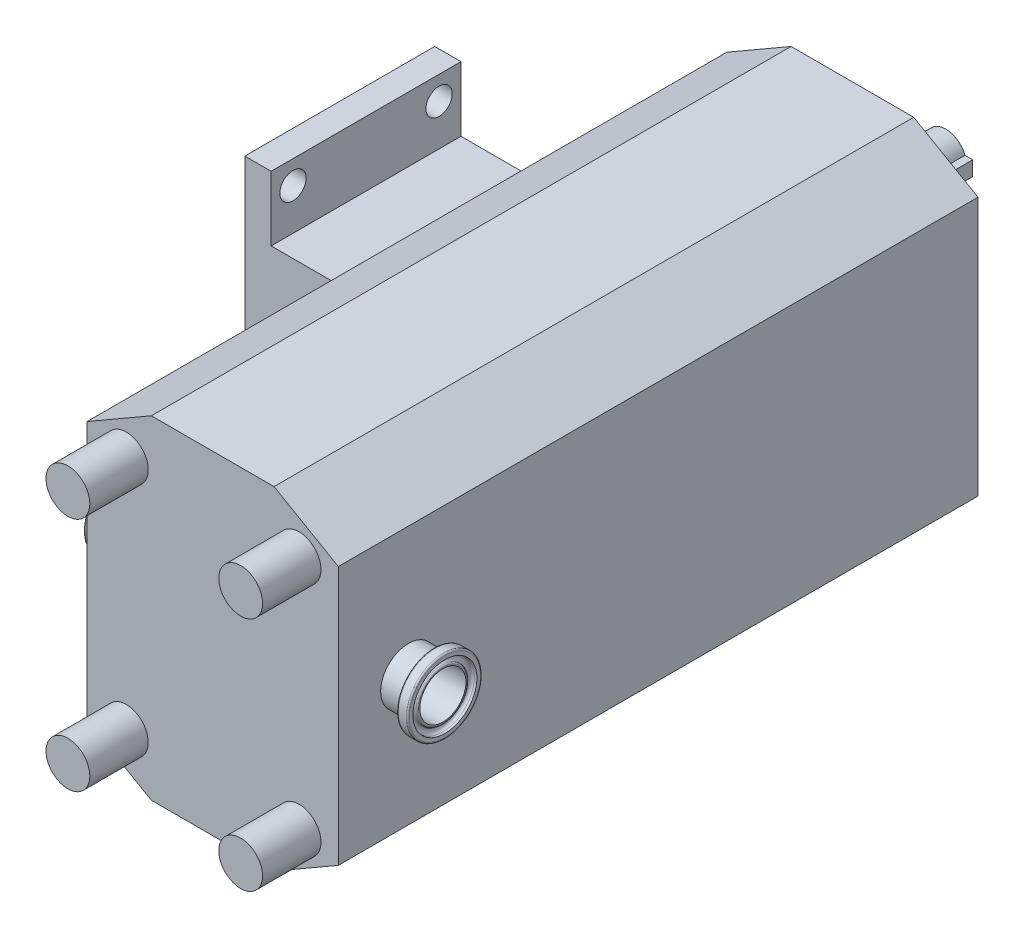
ISO-10303-21;
HEADER;
FILE_DESCRIPTION(('STEP AP214'),'2;1');
FILE_NAME('part.step','',(''),(''),'','','');
FILE_SCHEMA(('AUTOMOTIVE_DESIGN { 1 0 10303 214 1 1 1 1 }'));
ENDSEC;
DATA;
#1=APPLICATION_CONTEXT('core data for automotive mechanical design processes');
#2=APPLICATION_PROTOCOL_DEFINITION('international standard','automotive_design',2000,#1);
#3=PRODUCT_CONTEXT('',#1,'mechanical');
#4=PRODUCT('Part','Part','',(#3));
#5=PRODUCT_RELATED_PRODUCT_CATEGORY('part','',(#4));
#6=PRODUCT_DEFINITION_FORMATION('','',#4);
#7=PRODUCT_DEFINITION_CONTEXT('part definition',#1,'design');
#8=PRODUCT_DEFINITION('design','',#6,#7);
#9=PRODUCT_DEFINITION_SHAPE('','',#8);
#10=(LENGTH_UNIT() NAMED_UNIT(*) SI_UNIT(.MILLI.,.METRE.));
#11=(NAMED_UNIT(*) PLANE_ANGLE_UNIT() SI_UNIT($,.RADIAN.));
#12=(NAMED_UNIT(*) SI_UNIT($,.STERADIAN.) SOLID_ANGLE_UNIT());
#13=UNCERTAINTY_MEASURE_WITH_UNIT(LENGTH_MEASURE(1.E-05),#10,'distance_accuracy_value','');
#14=(GEOMETRIC_REPRESENTATION_CONTEXT(3) GLOBAL_UNCERTAINTY_ASSIGNED_CONTEXT((#13)) GLOBAL_UNIT_ASSIGNED_CONTEXT((#10,
#11,#12)) REPRESENTATION_CONTEXT('',''));
#15=CARTESIAN_POINT('',(0.,0.,0.));
#16=DIRECTION('',(0.,0.,1.));
#17=DIRECTION('',(1.,0.,0.));
#18=AXIS2_PLACEMENT_3D('',#15,#16,#17);
#19=CARTESIAN_POINT('',(-43.,-3.43439734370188,187.885584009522));
#20=DIRECTION('',(1.,0.,0.));
#21=DIRECTION('',(0.,0.900558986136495,-0.434733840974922));
#22=AXIS2_PLACEMENT_3D('',#19,#20,#21);
#23=PLANE('',#22);
#24=CARTESIAN_POINT('',(-43.,0.,195.));
#25=DIRECTION('',(-1.,0.,0.));
#26=DIRECTION('',(0.,-0.900558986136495,0.434733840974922));
#27=AXIS2_PLACEMENT_3D('',#24,#25,#26);
#28=CIRCLE('',#27,7.9);
#29=CARTESIAN_POINT('',(-43.,-7.1144159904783,198.434397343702));
#30=VERTEX_POINT('',#29);
#31=EDGE_CURVE('P0_E54',#30,#30,#28,.T.);
#32=ORIENTED_EDGE('',*,*,#31,.T.);
#33=EDGE_LOOP('',(#32));
#34=FACE_BOUND('',#33,.T.);
#35=CARTESIAN_POINT('',(-43.,0.,195.));
#36=DIRECTION('',(-1.,0.,0.));
#37=DIRECTION('',(0.,-0.900558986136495,0.434733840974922));
#38=AXIS2_PLACEMENT_3D('',#35,#36,#37);
#39=CIRCLE('',#38,9.49999999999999);
#40=CARTESIAN_POINT('',(-43.,-8.55531036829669,199.129971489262));
#41=VERTEX_POINT('',#40);
#42=EDGE_CURVE('P0_E9',#41,#41,#39,.T.);
#43=ORIENTED_EDGE('',*,*,#42,.F.);
#44=EDGE_LOOP('',(#43));
#45=FACE_BOUND('',#44,.T.);
#46=ADVANCED_FACE('P0_F14',(#34,#45),#23,.T.);
#47=CARTESIAN_POINT('',(-82.3263888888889,0.,195.));
#48=DIRECTION('',(-1.,0.,0.));
#49=DIRECTION('',(0.,-0.900558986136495,0.434733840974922));
#50=AXIS2_PLACEMENT_3D('',#47,#48,#49);
#51=CYLINDRICAL_SURFACE('',#50,9.49999999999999);
#52=ORIENTED_EDGE('',*,*,#42,.T.);
#53=EDGE_LOOP('',(#52));
#54=FACE_BOUND('',#53,.T.);
#55=CARTESIAN_POINT('',(-50.7152952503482,0.,195.));
#56=DIRECTION('',(-1.,0.,0.));
#57=DIRECTION('',(0.,-0.900558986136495,0.434733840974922));
#58=AXIS2_PLACEMENT_3D('',#55,#56,#57);
#59=CIRCLE('',#58,9.49999999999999);
#60=CARTESIAN_POINT('',(-50.7152952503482,-8.55531036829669,199.129971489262));
#61=VERTEX_POINT('',#60);
#62=EDGE_CURVE('P0_E20',#61,#61,#59,.T.);
#63=ORIENTED_EDGE('',*,*,#62,.F.);
#64=EDGE_LOOP('',(#63));
#65=FACE_BOUND('',#64,.T.);
#66=ADVANCED_FACE('P0_F73',(#54,#65),#51,.T.);
#67=CARTESIAN_POINT('',(-51.7602574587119,0.,195.));
#68=DIRECTION('',(-1.,0.,0.));
#69=DIRECTION('',(0.,-0.900558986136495,0.434733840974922));
#70=AXIS2_PLACEMENT_3D('',#67,#68,#69);
#71=CONICAL_SURFACE('',#70,12.3710100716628,1.22173047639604);
#72=ORIENTED_EDGE('',*,*,#62,.T.);
#73=EDGE_LOOP('',(#72));
#74=FACE_BOUND('',#73,.T.);
#75=CARTESIAN_POINT('',(-51.7602574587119,0.,195.));
#76=DIRECTION('',(-1.,0.,0.));
#77=DIRECTION('',(0.,-0.900558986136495,0.434733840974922));
#78=AXIS2_PLACEMENT_3D('',#75,#76,#77);
#79=CIRCLE('',#78,12.3710100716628);
#80=CARTESIAN_POINT('',(-51.7602574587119,-11.140824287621,200.378096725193));
#81=VERTEX_POINT('',#80);
#82=EDGE_CURVE('P0_E24',#81,#81,#79,.T.);
#83=ORIENTED_EDGE('',*,*,#82,.F.);
#84=EDGE_LOOP('',(#83));
#85=FACE_BOUND('',#84,.T.);
#86=ADVANCED_FACE('P0_F77',(#74,#85),#71,.T.);
#87=CARTESIAN_POINT('',(-52.2301037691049,0.,195.));
#88=DIRECTION('',(-1.,0.,0.));
#89=DIRECTION('',(0.,-0.900558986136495,0.434733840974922));
#90=AXIS2_PLACEMENT_3D('',#87,#88,#89);
#91=TOROIDAL_SURFACE('',#90,12.2,0.5);
#92=ORIENTED_EDGE('',*,*,#82,.T.);
#93=EDGE_LOOP('',(#92));
#94=FACE_BOUND('',#93,.T.);
#95=CARTESIAN_POINT('',(-52.2301037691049,0.,195.));
#96=DIRECTION('',(-1.,0.,0.));
#97=DIRECTION('',(0.,-0.900558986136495,0.434733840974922));
#98=AXIS2_PLACEMENT_3D('',#95,#96,#97);
#99=CIRCLE('',#98,12.7);
#100=CARTESIAN_POINT('',(-52.2301037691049,-11.4370991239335,200.521119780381));
#101=VERTEX_POINT('',#100);
#102=EDGE_CURVE('P0_E28',#101,#101,#99,.T.);
#103=ORIENTED_EDGE('',*,*,#102,.F.);
#104=EDGE_LOOP('',(#103));
#105=FACE_BOUND('',#104,.T.);
#106=ADVANCED_FACE('P0_F81',(#94,#105),#91,.T.);
#107=CARTESIAN_POINT('',(-82.3263888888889,0.,195.));
#108=DIRECTION('',(-1.,0.,0.));
#109=DIRECTION('',(0.,-0.900558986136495,0.434733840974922));
#110=AXIS2_PLACEMENT_3D('',#107,#108,#109);
#111=CYLINDRICAL_SURFACE('',#110,12.7);
#112=ORIENTED_EDGE('',*,*,#102,.T.);
#113=EDGE_LOOP('',(#112));
#114=FACE_BOUND('',#113,.T.);
#115=CARTESIAN_POINT('',(-55.,0.,195.));
#116=DIRECTION('',(-1.,0.,0.));
#117=DIRECTION('',(0.,-0.900558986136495,0.434733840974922));
#118=AXIS2_PLACEMENT_3D('',#115,#116,#117);
#119=CIRCLE('',#118,12.7);
#120=CARTESIAN_POINT('',(-55.,-11.4370991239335,200.521119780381));
#121=VERTEX_POINT('',#120);
#122=EDGE_CURVE('P0_E33',#121,#121,#119,.T.);
#123=ORIENTED_EDGE('',*,*,#122,.F.);
#124=EDGE_LOOP('',(#123));
#125=FACE_BOUND('',#124,.T.);
#126=ADVANCED_FACE('P0_F87',(#114,#125),#111,.T.);
#127=CARTESIAN_POINT('',(-55.,0.,195.));
#128=DIRECTION('',(-1.,0.,0.));
#129=DIRECTION('',(0.,-0.900558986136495,0.434733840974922));
#130=AXIS2_PLACEMENT_3D('',#127,#128,#129);
#131=TOROIDAL_SURFACE('',#130,12.2,0.5);
#132=ORIENTED_EDGE('',*,*,#122,.T.);
#133=EDGE_LOOP('',(#132));
#134=FACE_BOUND('',#133,.T.);
#135=CARTESIAN_POINT('',(-55.5,0.,195.));
#136=DIRECTION('',(-1.,0.,0.));
#137=DIRECTION('',(0.,-0.900558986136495,0.434733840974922));
#138=AXIS2_PLACEMENT_3D('',#135,#136,#137);
#139=CIRCLE('',#138,12.2);
#140=CARTESIAN_POINT('',(-55.5,-10.9868196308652,200.303752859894));
#141=VERTEX_POINT('',#140);
#142=EDGE_CURVE('P0_E36',#141,#141,#139,.T.);
#143=ORIENTED_EDGE('',*,*,#142,.F.);
#144=EDGE_LOOP('',(#143));
#145=FACE_BOUND('',#144,.T.);
#146=ADVANCED_FACE('P0_F91',(#134,#145),#131,.T.);
#147=CARTESIAN_POINT('',(-55.5,-5.30375285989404,184.013180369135));
#148=DIRECTION('',(-1.,0.,0.));
#149=DIRECTION('',(0.,-0.900558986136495,0.434733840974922));
#150=AXIS2_PLACEMENT_3D('',#147,#148,#149);
#151=PLANE('',#150);
#152=ORIENTED_EDGE('',*,*,#142,.T.);
#153=EDGE_LOOP('',(#152));
#154=FACE_BOUND('',#153,.T.);
#155=CARTESIAN_POINT('',(-55.5,0.,195.));
#156=DIRECTION('',(-1.,0.,0.));
#157=DIRECTION('',(0.,-0.900558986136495,0.434733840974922));
#158=AXIS2_PLACEMENT_3D('',#155,#156,#157);
#159=CIRCLE('',#158,10.95);
#160=CARTESIAN_POINT('',(-55.5,-9.8611208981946,199.760335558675));
#161=VERTEX_POINT('',#160);
#162=EDGE_CURVE('P0_E39',#161,#161,#159,.T.);
#163=ORIENTED_EDGE('',*,*,#162,.F.);
#164=EDGE_LOOP('',(#163));
#165=FACE_BOUND('',#164,.T.);
#166=ADVANCED_FACE('P0_F95',(#154,#165),#151,.T.);
#167=CARTESIAN_POINT('',(-82.3263888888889,0.,195.));
#168=DIRECTION('',(-1.,0.,0.));
#169=DIRECTION('',(0.,-0.900558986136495,0.434733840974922));
#170=AXIS2_PLACEMENT_3D('',#167,#168,#169);
#171=CYLINDRICAL_SURFACE('',#170,10.95);
#172=ORIENTED_EDGE('',*,*,#162,.T.);
#173=EDGE_LOOP('',(#172));
#174=FACE_BOUND('',#173,.T.);
#175=CARTESIAN_POINT('',(-54.66,0.,195.));
#176=DIRECTION('',(-1.,0.,0.));
#177=DIRECTION('',(0.,-0.900558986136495,0.434733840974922));
#178=AXIS2_PLACEMENT_3D('',#175,#176,#177);
#179=CIRCLE('',#178,10.95);
#180=CARTESIAN_POINT('',(-54.66,-9.8611208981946,199.760335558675));
#181=VERTEX_POINT('',#180);
#182=EDGE_CURVE('P0_E42',#181,#181,#179,.T.);
#183=ORIENTED_EDGE('',*,*,#182,.F.);
#184=EDGE_LOOP('',(#183));
#185=FACE_BOUND('',#184,.T.);
#186=ADVANCED_FACE('P0_F99',(#174,#185),#171,.F.);
#187=CARTESIAN_POINT('',(-54.66,0.,195.));
#188=DIRECTION('',(-1.,0.,0.));
#189=DIRECTION('',(0.,-0.900558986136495,0.434733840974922));
#190=AXIS2_PLACEMENT_3D('',#187,#188,#189);
#191=TOROIDAL_SURFACE('',#190,9.84999999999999,1.1);
#192=ORIENTED_EDGE('',*,*,#182,.T.);
#193=EDGE_LOOP('',(#192));
#194=FACE_BOUND('',#193,.T.);
#195=CARTESIAN_POINT('',(-54.4125,0.,195.));
#196=DIRECTION('',(-1.,0.,0.));
#197=DIRECTION('',(0.,-0.900558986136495,0.434733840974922));
#198=AXIS2_PLACEMENT_3D('',#195,#196,#197);
#199=CIRCLE('',#198,8.77820536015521);
#200=CARTESIAN_POINT('',(-54.4125,-7.90529171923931,198.816182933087));
#201=VERTEX_POINT('',#200);
#202=EDGE_CURVE('P0_E45',#201,#201,#199,.T.);
#203=ORIENTED_EDGE('',*,*,#202,.F.);
#204=EDGE_LOOP('',(#203));
#205=FACE_BOUND('',#204,.T.);
#206=ADVANCED_FACE('P0_F103',(#194,#205),#191,.F.);
#207=CARTESIAN_POINT('',(-54.3,0.,195.));
#208=DIRECTION('',(-1.,0.,0.));
#209=DIRECTION('',(0.,-0.900558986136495,0.434733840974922));
#210=AXIS2_PLACEMENT_3D('',#207,#208,#209);
#211=TOROIDAL_SURFACE('',#210,8.29102597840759,0.499999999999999);
#212=ORIENTED_EDGE('',*,*,#202,.T.);
#213=EDGE_LOOP('',(#212));
#214=FACE_BOUND('',#213,.T.);
#215=CARTESIAN_POINT('',(-54.8,0.,195.));
#216=DIRECTION('',(-1.,0.,0.));
#217=DIRECTION('',(0.,-0.900558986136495,0.434733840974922));
#218=AXIS2_PLACEMENT_3D('',#215,#216,#217);
#219=CIRCLE('',#218,8.29102597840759);
#220=CARTESIAN_POINT('',(-54.8,-7.46655794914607,198.604389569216));
#221=VERTEX_POINT('',#220);
#222=EDGE_CURVE('P0_E48',#221,#221,#219,.T.);
#223=ORIENTED_EDGE('',*,*,#222,.F.);
#224=EDGE_LOOP('',(#223));
#225=FACE_BOUND('',#224,.T.);
#226=ADVANCED_FACE('P0_F69',(#214,#225),#211,.T.);
#227=CARTESIAN_POINT('',(-54.8,-3.43439734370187,187.885584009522));
#228=DIRECTION('',(-1.,0.,0.));
#229=DIRECTION('',(0.,-0.900558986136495,0.434733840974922));
#230=AXIS2_PLACEMENT_3D('',#227,#228,#229);
#231=PLANE('',#230);
#232=ORIENTED_EDGE('',*,*,#222,.T.);
#233=EDGE_LOOP('',(#232));
#234=FACE_BOUND('',#233,.T.);
#235=CARTESIAN_POINT('',(-54.8,0.,195.));
#236=DIRECTION('',(-1.,0.,0.));
#237=DIRECTION('',(0.,-0.900558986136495,0.434733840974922));
#238=AXIS2_PLACEMENT_3D('',#235,#236,#237);
#239=CIRCLE('',#238,7.9);
#240=CARTESIAN_POINT('',(-54.8,-7.1144159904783,198.434397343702));
#241=VERTEX_POINT('',#240);
#242=EDGE_CURVE('P0_E51',#241,#241,#239,.T.);
#243=ORIENTED_EDGE('',*,*,#242,.F.);
#244=EDGE_LOOP('',(#243));
#245=FACE_BOUND('',#244,.T.);
#246=ADVANCED_FACE('P0_F62',(#234,#245),#231,.T.);
#247=CARTESIAN_POINT('',(-82.3263888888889,0.,195.));
#248=DIRECTION('',(-1.,0.,0.));
#249=DIRECTION('',(0.,-0.900558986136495,0.434733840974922));
#250=AXIS2_PLACEMENT_3D('',#247,#248,#249);
#251=CYLINDRICAL_SURFACE('',#250,7.9);
#252=ORIENTED_EDGE('',*,*,#242,.T.);
#253=EDGE_LOOP('',(#252));
#254=FACE_BOUND('',#253,.T.);
#255=ORIENTED_EDGE('',*,*,#31,.F.);
#256=EDGE_LOOP('',(#255));
#257=FACE_BOUND('',#256,.T.);
#258=ADVANCED_FACE('P0_F60',(#254,#257),#251,.F.);
#259=CLOSED_SHELL('',(#46,#66,#86,#106,#126,#146,#166,#186,#206,#226,#246,#258));
#260=MANIFOLD_SOLID_BREP('P0_B1',#259);
#261=CARTESIAN_POINT('',(43.,-7.87685591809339,195.604268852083));
#262=DIRECTION('',(-1.,0.,0.));
#263=DIRECTION('',(0.,0.0764897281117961,0.997070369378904));
#264=AXIS2_PLACEMENT_3D('',#261,#262,#263);
#265=PLANE('',#264);
#266=CARTESIAN_POINT('',(43.,0.,195.));
#267=DIRECTION('',(1.,0.,0.));
#268=DIRECTION('',(0.,-0.0764897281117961,-0.997070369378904));
#269=AXIS2_PLACEMENT_3D('',#266,#267,#268);
#270=CIRCLE('',#269,7.9);
#271=CARTESIAN_POINT('',(43.,-0.604268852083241,187.123144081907));
#272=VERTEX_POINT('',#271);
#273=EDGE_CURVE('P1_E55',#272,#272,#270,.T.);
#274=ORIENTED_EDGE('',*,*,#273,.T.);
#275=EDGE_LOOP('',(#274));
#276=FACE_BOUND('',#275,.T.);
#277=CARTESIAN_POINT('',(43.,0.,195.));
#278=DIRECTION('',(1.,0.,0.));
#279=DIRECTION('',(0.,-0.0764897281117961,-0.997070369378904));
#280=AXIS2_PLACEMENT_3D('',#277,#278,#279);
#281=CIRCLE('',#280,9.49999999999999);
#282=CARTESIAN_POINT('',(43.,-0.726652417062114,185.5278314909));
#283=VERTEX_POINT('',#282);
#284=EDGE_CURVE('P1_E10',#283,#283,#281,.T.);
#285=ORIENTED_EDGE('',*,*,#284,.F.);
#286=EDGE_LOOP('',(#285));
#287=FACE_BOUND('',#286,.T.);
#288=ADVANCED_FACE('P1_F15',(#276,#287),#265,.T.);
#289=CARTESIAN_POINT('',(82.3263888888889,0.,195.));
#290=DIRECTION('',(1.,0.,0.));
#291=DIRECTION('',(0.,-0.0764897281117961,-0.997070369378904));
#292=AXIS2_PLACEMENT_3D('',#289,#290,#291);
#293=CYLINDRICAL_SURFACE('',#292,9.49999999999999);
#294=ORIENTED_EDGE('',*,*,#284,.T.);
#295=EDGE_LOOP('',(#294));
#296=FACE_BOUND('',#295,.T.);
#297=CARTESIAN_POINT('',(50.7152952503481,0.,195.));
#298=DIRECTION('',(1.,0.,0.));
#299=DIRECTION('',(0.,-0.0764897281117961,-0.997070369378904));
#300=AXIS2_PLACEMENT_3D('',#297,#298,#299);
#301=CIRCLE('',#300,9.49999999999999);
#302=CARTESIAN_POINT('',(50.7152952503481,-0.726652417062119,185.5278314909));
#303=VERTEX_POINT('',#302);
#304=EDGE_CURVE('P1_E21',#303,#303,#301,.T.);
#305=ORIENTED_EDGE('',*,*,#304,.F.);
#306=EDGE_LOOP('',(#305));
#307=FACE_BOUND('',#306,.T.);
#308=ADVANCED_FACE('P1_F74',(#296,#307),#293,.T.);
#309=CARTESIAN_POINT('',(51.7602574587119,0.,195.));
#310=DIRECTION('',(1.,0.,0.));
#311=DIRECTION('',(0.,-0.0764897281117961,-0.997070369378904));
#312=AXIS2_PLACEMENT_3D('',#309,#310,#311);
#313=CONICAL_SURFACE('',#312,12.3710100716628,1.22173047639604);
#314=ORIENTED_EDGE('',*,*,#304,.T.);
#315=EDGE_LOOP('',(#314));
#316=FACE_BOUND('',#315,.T.);
#317=CARTESIAN_POINT('',(51.7602574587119,0.,195.));
#318=DIRECTION('',(1.,0.,0.));
#319=DIRECTION('',(0.,-0.0764897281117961,-0.997070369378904));
#320=AXIS2_PLACEMENT_3D('',#317,#318,#319);
#321=CIRCLE('',#320,12.3710100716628);
#322=CARTESIAN_POINT('',(51.7602574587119,-0.946255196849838,182.665232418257));
#323=VERTEX_POINT('',#322);
#324=EDGE_CURVE('P1_E25',#323,#323,#321,.T.);
#325=ORIENTED_EDGE('',*,*,#324,.F.);
#326=EDGE_LOOP('',(#325));
#327=FACE_BOUND('',#326,.T.);
#328=ADVANCED_FACE('P1_F78',(#316,#327),#313,.T.);
#329=CARTESIAN_POINT('',(52.2301037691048,0.,195.));
#330=DIRECTION('',(1.,0.,0.));
#331=DIRECTION('',(0.,-0.0764897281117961,-0.997070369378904));
#332=AXIS2_PLACEMENT_3D('',#329,#330,#331);
#333=TOROIDAL_SURFACE('',#332,12.2,0.5);
#334=ORIENTED_EDGE('',*,*,#324,.T.);
#335=EDGE_LOOP('',(#334));
#336=FACE_BOUND('',#335,.T.);
#337=CARTESIAN_POINT('',(52.2301037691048,0.,195.));
#338=DIRECTION('',(1.,0.,0.));
#339=DIRECTION('',(0.,-0.0764897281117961,-0.997070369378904));
#340=AXIS2_PLACEMENT_3D('',#337,#338,#339);
#341=CIRCLE('',#340,12.7);
#342=CARTESIAN_POINT('',(52.2301037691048,-0.971419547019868,182.337206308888));
#343=VERTEX_POINT('',#342);
#344=EDGE_CURVE('P1_E29',#343,#343,#341,.T.);
#345=ORIENTED_EDGE('',*,*,#344,.F.);
#346=EDGE_LOOP('',(#345));
#347=FACE_BOUND('',#346,.T.);
#348=ADVANCED_FACE('P1_F82',(#336,#347),#333,.T.);
#349=CARTESIAN_POINT('',(82.3263888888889,0.,195.));
#350=DIRECTION('',(1.,0.,0.));
#351=DIRECTION('',(0.,-0.0764897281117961,-0.997070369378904));
#352=AXIS2_PLACEMENT_3D('',#349,#350,#351);
#353=CYLINDRICAL_SURFACE('',#352,12.7);
#354=ORIENTED_EDGE('',*,*,#344,.T.);
#355=EDGE_LOOP('',(#354));
#356=FACE_BOUND('',#355,.T.);
#357=CARTESIAN_POINT('',(55.,0.,195.));
#358=DIRECTION('',(1.,0.,0.));
#359=DIRECTION('',(0.,-0.0764897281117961,-0.997070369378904));
#360=AXIS2_PLACEMENT_3D('',#357,#358,#359);
#361=CIRCLE('',#360,12.7);
#362=CARTESIAN_POINT('',(55.,-0.971419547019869,182.337206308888));
#363=VERTEX_POINT('',#362);
#364=EDGE_CURVE('P1_E34',#363,#363,#361,.T.);
#365=ORIENTED_EDGE('',*,*,#364,.F.);
#366=EDGE_LOOP('',(#365));
#367=FACE_BOUND('',#366,.T.);
#368=ADVANCED_FACE('P1_F88',(#356,#367),#353,.T.);
#369=CARTESIAN_POINT('',(55.,0.,195.));
#370=DIRECTION('',(1.,0.,0.));
#371=DIRECTION('',(0.,-0.0764897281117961,-0.997070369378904));
#372=AXIS2_PLACEMENT_3D('',#369,#370,#371);
#373=TOROIDAL_SURFACE('',#372,12.2,0.5);
#374=ORIENTED_EDGE('',*,*,#364,.T.);
#375=EDGE_LOOP('',(#374));
#376=FACE_BOUND('',#375,.T.);
#377=CARTESIAN_POINT('',(55.5,0.,195.));
#378=DIRECTION('',(1.,0.,0.));
#379=DIRECTION('',(0.,-0.0764897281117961,-0.997070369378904));
#380=AXIS2_PLACEMENT_3D('',#377,#378,#379);
#381=CIRCLE('',#380,12.2);
#382=CARTESIAN_POINT('',(55.5,-0.933174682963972,182.835741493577));
#383=VERTEX_POINT('',#382);
#384=EDGE_CURVE('P1_E37',#383,#383,#381,.T.);
#385=ORIENTED_EDGE('',*,*,#384,.F.);
#386=EDGE_LOOP('',(#385));
#387=FACE_BOUND('',#386,.T.);
#388=ADVANCED_FACE('P1_F92',(#376,#387),#373,.T.);
#389=CARTESIAN_POINT('',(55.5,-12.1642585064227,195.933174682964));
#390=DIRECTION('',(1.,0.,0.));
#391=DIRECTION('',(0.,-0.0764897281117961,-0.997070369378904));
#392=AXIS2_PLACEMENT_3D('',#389,#390,#391);
#393=PLANE('',#392);
#394=ORIENTED_EDGE('',*,*,#384,.T.);
#395=EDGE_LOOP('',(#394));
#396=FACE_BOUND('',#395,.T.);
#397=CARTESIAN_POINT('',(55.5,0.,195.));
#398=DIRECTION('',(1.,0.,0.));
#399=DIRECTION('',(0.,-0.0764897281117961,-0.997070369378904));
#400=AXIS2_PLACEMENT_3D('',#397,#398,#399);
#401=CIRCLE('',#400,10.95);
#402=CARTESIAN_POINT('',(55.5,-0.837562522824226,184.082079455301));
#403=VERTEX_POINT('',#402);
#404=EDGE_CURVE('P1_E40',#403,#403,#401,.T.);
#405=ORIENTED_EDGE('',*,*,#404,.F.);
#406=EDGE_LOOP('',(#405));
#407=FACE_BOUND('',#406,.T.);
#408=ADVANCED_FACE('P1_F96',(#396,#407),#393,.T.);
#409=CARTESIAN_POINT('',(82.3263888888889,0.,195.));
#410=DIRECTION('',(1.,0.,0.));
#411=DIRECTION('',(0.,-0.0764897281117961,-0.997070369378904));
#412=AXIS2_PLACEMENT_3D('',#409,#410,#411);
#413=CYLINDRICAL_SURFACE('',#412,10.95);
#414=ORIENTED_EDGE('',*,*,#404,.T.);
#415=EDGE_LOOP('',(#414));
#416=FACE_BOUND('',#415,.T.);
#417=CARTESIAN_POINT('',(54.66,0.,195.));
#418=DIRECTION('',(1.,0.,0.));
#419=DIRECTION('',(0.,-0.0764897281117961,-0.997070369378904));
#420=AXIS2_PLACEMENT_3D('',#417,#418,#419);
#421=CIRCLE('',#420,10.95);
#422=CARTESIAN_POINT('',(54.66,-0.837562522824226,184.082079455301));
#423=VERTEX_POINT('',#422);
#424=EDGE_CURVE('P1_E43',#423,#423,#421,.T.);
#425=ORIENTED_EDGE('',*,*,#424,.F.);
#426=EDGE_LOOP('',(#425));
#427=FACE_BOUND('',#426,.T.);
#428=ADVANCED_FACE('P1_F100',(#416,#427),#413,.F.);
#429=CARTESIAN_POINT('',(54.66,0.,195.));
#430=DIRECTION('',(1.,0.,0.));
#431=DIRECTION('',(0.,-0.0764897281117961,-0.997070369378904));
#432=AXIS2_PLACEMENT_3D('',#429,#430,#431);
#433=TOROIDAL_SURFACE('',#432,9.84999999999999,1.1);
#434=ORIENTED_EDGE('',*,*,#424,.T.);
#435=EDGE_LOOP('',(#434));
#436=FACE_BOUND('',#435,.T.);
#437=CARTESIAN_POINT('',(54.4125,0.,195.));
#438=DIRECTION('',(1.,0.,0.));
#439=DIRECTION('',(0.,-0.0764897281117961,-0.997070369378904));
#440=AXIS2_PLACEMENT_3D('',#437,#438,#439);
#441=CIRCLE('',#440,8.77820536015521);
#442=CARTESIAN_POINT('',(54.4125,-0.671442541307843,186.247511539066));
#443=VERTEX_POINT('',#442);
#444=EDGE_CURVE('P1_E46',#443,#443,#441,.T.);
#445=ORIENTED_EDGE('',*,*,#444,.F.);
#446=EDGE_LOOP('',(#445));
#447=FACE_BOUND('',#446,.T.);
#448=ADVANCED_FACE('P1_F104',(#436,#447),#433,.F.);
#449=CARTESIAN_POINT('',(54.3,0.,195.));
#450=DIRECTION('',(1.,0.,0.));
#451=DIRECTION('',(0.,-0.0764897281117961,-0.997070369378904));
#452=AXIS2_PLACEMENT_3D('',#449,#450,#451);
#453=TOROIDAL_SURFACE('',#452,8.29102597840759,0.499999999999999);
#454=ORIENTED_EDGE('',*,*,#444,.T.);
#455=EDGE_LOOP('',(#454));
#456=FACE_BOUND('',#455,.T.);
#457=CARTESIAN_POINT('',(54.8,0.,195.));
#458=DIRECTION('',(1.,0.,0.));
#459=DIRECTION('',(0.,-0.0764897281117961,-0.997070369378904));
#460=AXIS2_PLACEMENT_3D('',#457,#458,#459);
#461=CIRCLE('',#460,8.29102597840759);
#462=CARTESIAN_POINT('',(54.8,-0.634178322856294,186.733263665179));
#463=VERTEX_POINT('',#462);
#464=EDGE_CURVE('P1_E49',#463,#463,#461,.T.);
#465=ORIENTED_EDGE('',*,*,#464,.F.);
#466=EDGE_LOOP('',(#465));
#467=FACE_BOUND('',#466,.T.);
#468=ADVANCED_FACE('P1_F70',(#456,#467),#453,.T.);
#469=CARTESIAN_POINT('',(54.8,-7.87685591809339,195.604268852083));
#470=DIRECTION('',(1.,0.,0.));
#471=DIRECTION('',(0.,-0.0764897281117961,-0.997070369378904));
#472=AXIS2_PLACEMENT_3D('',#469,#470,#471);
#473=PLANE('',#472);
#474=ORIENTED_EDGE('',*,*,#464,.T.);
#475=EDGE_LOOP('',(#474));
#476=FACE_BOUND('',#475,.T.);
#477=CARTESIAN_POINT('',(54.8,0.,195.));
#478=DIRECTION('',(1.,0.,0.));
#479=DIRECTION('',(0.,-0.0764897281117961,-0.997070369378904));
#480=AXIS2_PLACEMENT_3D('',#477,#478,#479);
#481=CIRCLE('',#480,7.9);
#482=CARTESIAN_POINT('',(54.8,-0.604268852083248,187.123144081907));
#483=VERTEX_POINT('',#482);
#484=EDGE_CURVE('P1_E52',#483,#483,#481,.T.);
#485=ORIENTED_EDGE('',*,*,#484,.F.);
#486=EDGE_LOOP('',(#485));
#487=FACE_BOUND('',#486,.T.);
#488=ADVANCED_FACE('P1_F63',(#476,#487),#473,.T.);
#489=CARTESIAN_POINT('',(82.3263888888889,0.,195.));
#490=DIRECTION('',(1.,0.,0.));
#491=DIRECTION('',(0.,-0.0764897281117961,-0.997070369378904));
#492=AXIS2_PLACEMENT_3D('',#489,#490,#491);
#493=CYLINDRICAL_SURFACE('',#492,7.9);
#494=ORIENTED_EDGE('',*,*,#484,.T.);
#495=EDGE_LOOP('',(#494));
#496=FACE_BOUND('',#495,.T.);
#497=ORIENTED_EDGE('',*,*,#273,.F.);
#498=EDGE_LOOP('',(#497));
#499=FACE_BOUND('',#498,.T.);
#500=ADVANCED_FACE('P1_F61',(#496,#499),#493,.F.);
#501=CLOSED_SHELL('',(#288,#308,#328,#348,#368,#388,#408,#428,#448,#468,#488,#500));
#502=MANIFOLD_SOLID_BREP('P1_B1',#501);
#503=CARTESIAN_POINT('',(-43.,-44.2982940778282,219.));
#504=DIRECTION('',(1.,0.,0.));
#505=DIRECTION('',(0.,0.,-1.));
#506=AXIS2_PLACEMENT_3D('',#503,#504,#505);
#507=PLANE('',#506);
#508=DIRECTION('',(0.,-1.,0.));
#509=VECTOR('',#508,1.);
#510=CARTESIAN_POINT('',(-43.,-44.2982940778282,0.));
#511=LINE('',#510,#509);
#512=CARTESIAN_POINT('',(-43.,44.2982940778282,0.));
#513=VERTEX_POINT('',#512);
#514=CARTESIAN_POINT('',(-43.,-44.2982940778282,0.));
#515=VERTEX_POINT('',#514);
#516=EDGE_CURVE('P2_E290',#513,#515,#511,.T.);
#517=ORIENTED_EDGE('',*,*,#516,.T.);
#518=DIRECTION('',(0.,0.,-1.));
#519=VECTOR('',#518,1.);
#520=CARTESIAN_POINT('',(-43.,-44.2982940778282,219.));
#521=LINE('',#520,#519);
#522=CARTESIAN_POINT('',(-43.,-44.2982940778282,219.));
#523=VERTEX_POINT('',#522);
#524=EDGE_CURVE('P2_E320',#523,#515,#521,.T.);
#525=ORIENTED_EDGE('',*,*,#524,.F.);
#526=DIRECTION('',(0.,-1.,0.));
#527=VECTOR('',#526,1.);
#528=CARTESIAN_POINT('',(-43.,-44.2982940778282,219.));
#529=LINE('',#528,#527);
#530=CARTESIAN_POINT('',(-43.,44.2982940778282,219.));
#531=VERTEX_POINT('',#530);
#532=EDGE_CURVE('P2_E272',#531,#523,#529,.T.);
#533=ORIENTED_EDGE('',*,*,#532,.F.);
#534=DIRECTION('',(0.,0.,-1.));
#535=VECTOR('',#534,1.);
#536=CARTESIAN_POINT('',(-43.,44.2982940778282,219.));
#537=LINE('',#536,#535);
#538=EDGE_CURVE('P2_E323',#531,#513,#537,.T.);
#539=ORIENTED_EDGE('',*,*,#538,.T.);
#540=EDGE_LOOP('',(#517,#525,#533,#539));
#541=FACE_BOUND('',#540,.T.);
#542=CARTESIAN_POINT('',(-43.,0.,195.));
#543=DIRECTION('',(1.,0.,0.));
#544=DIRECTION('',(0.,1.,0.));
#545=AXIS2_PLACEMENT_3D('',#542,#543,#544);
#546=CIRCLE('',#545,8.00000000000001);
#547=CARTESIAN_POINT('',(-43.,8.00000000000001,195.));
#548=VERTEX_POINT('',#547);
#549=EDGE_CURVE('P2_E214',#548,#548,#546,.T.);
#550=ORIENTED_EDGE('',*,*,#549,.T.);
#551=EDGE_LOOP('',(#550));
#552=FACE_BOUND('',#551,.T.);
#553=DIRECTION('',(0.,-1.,0.));
#554=VECTOR('',#553,1.);
#555=CARTESIAN_POINT('',(-43.,-44.2982940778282,63.));
#556=LINE('',#555,#554);
#557=CARTESIAN_POINT('',(-43.,36.8601182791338,63.));
#558=VERTEX_POINT('',#557);
#559=CARTESIAN_POINT('',(-43.,-36.8601182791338,63.));
#560=VERTEX_POINT('',#559);
#561=EDGE_CURVE('P2_E11',#558,#560,#556,.T.);
#562=ORIENTED_EDGE('',*,*,#561,.F.);
#563=DIRECTION('',(0.,0.,-1.));
#564=VECTOR('',#563,1.);
#565=CARTESIAN_POINT('',(-43.,36.8601182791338,219.));
#566=LINE('',#565,#564);
#567=CARTESIAN_POINT('',(-43.,36.8601182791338,128.));
#568=VERTEX_POINT('',#567);
#569=EDGE_CURVE('P2_E570',#568,#558,#566,.T.);
#570=ORIENTED_EDGE('',*,*,#569,.F.);
#571=DIRECTION('',(0.,-1.,0.));
#572=VECTOR('',#571,1.);
#573=CARTESIAN_POINT('',(-43.,-44.2982940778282,128.));
#574=LINE('',#573,#572);
#575=CARTESIAN_POINT('',(-43.,-36.8601182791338,128.));
#576=VERTEX_POINT('',#575);
#577=EDGE_CURVE('P2_E343',#568,#576,#574,.T.);
#578=ORIENTED_EDGE('',*,*,#577,.T.);
#579=DIRECTION('',(0.,0.,1.));
#580=VECTOR('',#579,1.);
#581=CARTESIAN_POINT('',(-43.,-36.8601182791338,219.));
#582=LINE('',#581,#580);
#583=EDGE_CURVE('P2_E25',#560,#576,#582,.T.);
#584=ORIENTED_EDGE('',*,*,#583,.F.);
#585=EDGE_LOOP('',(#562,#570,#578,#584));
#586=FACE_BOUND('',#585,.T.);
#587=ADVANCED_FACE('P2_F17',(#541,#552,#586),#507,.F.);
#588=CARTESIAN_POINT('',(0.,20.,219.362441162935));
#589=DIRECTION('',(0.,0.,1.));
#590=DIRECTION('',(1.,0.,0.));
#591=AXIS2_PLACEMENT_3D('',#588,#589,#590);
#592=CYLINDRICAL_SURFACE('',#591,7.);
#593=CARTESIAN_POINT('',(0.,20.,-2.));
#594=DIRECTION('',(0.,0.,1.));
#595=DIRECTION('',(1.,0.,0.));
#596=AXIS2_PLACEMENT_3D('',#593,#594,#595);
#597=CIRCLE('',#596,7.);
#598=CARTESIAN_POINT('',(7.,20.,-2.));
#599=VERTEX_POINT('',#598);
#600=EDGE_CURVE('P2_E247',#599,#599,#597,.T.);
#601=ORIENTED_EDGE('',*,*,#600,.F.);
#602=EDGE_LOOP('',(#601));
#603=FACE_BOUND('',#602,.T.);
#604=DIRECTION('',(0.,0.,1.));
#605=VECTOR('',#604,1.);
#606=CARTESIAN_POINT('',(6.53834841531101,22.5,219.362441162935));
#607=LINE('',#606,#605);
#608=CARTESIAN_POINT('',(6.53834841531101,22.5,-32.));
#609=VERTEX_POINT('',#608);
#610=CARTESIAN_POINT('',(6.53834841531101,22.5,-17.));
#611=VERTEX_POINT('',#610);
#612=EDGE_CURVE('P2_E243',#609,#611,#607,.T.);
#613=ORIENTED_EDGE('',*,*,#612,.F.);
#614=CARTESIAN_POINT('',(0.,20.,-32.));
#615=DIRECTION('',(0.,0.,1.));
#616=DIRECTION('',(1.,0.,0.));
#617=AXIS2_PLACEMENT_3D('',#614,#615,#616);
#618=CIRCLE('',#617,7.);
#619=CARTESIAN_POINT('',(6.53834841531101,17.5,-32.));
#620=VERTEX_POINT('',#619);
#621=EDGE_CURVE('P2_E245',#609,#620,#618,.T.);
#622=ORIENTED_EDGE('',*,*,#621,.T.);
#623=DIRECTION('',(0.,0.,1.));
#624=VECTOR('',#623,1.);
#625=CARTESIAN_POINT('',(6.53834841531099,17.4999999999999,219.362441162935));
#626=LINE('',#625,#624);
#627=CARTESIAN_POINT('',(6.53834841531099,17.4999999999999,-17.));
#628=VERTEX_POINT('',#627);
#629=EDGE_CURVE('P2_E240',#628,#620,#626,.F.);
#630=ORIENTED_EDGE('',*,*,#629,.F.);
#631=CARTESIAN_POINT('',(7.,20.,-19.5));
#632=CARTESIAN_POINT('',(7.0000020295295,20.1358397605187,-19.5000028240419));
#633=CARTESIAN_POINT('',(6.99601056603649,20.2716594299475,-19.4888932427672));
#634=CARTESIAN_POINT('',(6.98048404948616,20.5392648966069,-19.444908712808));
#635=CARTESIAN_POINT('',(6.96894928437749,20.6710508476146,-19.4120345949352));
#636=CARTESIAN_POINT('',(6.93958109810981,20.9266921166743,-19.3258148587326));
#637=CARTESIAN_POINT('',(6.92175912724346,21.0505613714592,-19.2725064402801));
#638=CARTESIAN_POINT('',(6.88161078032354,21.287595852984,-19.1471112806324));
#639=CARTESIAN_POINT('',(6.85928332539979,21.4007585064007,-19.075020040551));
#640=CARTESIAN_POINT('',(6.81147377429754,21.6175880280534,-18.9111568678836));
#641=CARTESIAN_POINT('',(6.78590827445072,21.7207801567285,-18.8187812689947));
#642=CARTESIAN_POINT('',(6.73493522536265,21.9105819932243,-18.6182536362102));
#643=CARTESIAN_POINT('',(6.70952771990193,21.9971872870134,-18.5100974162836));
#644=CARTESIAN_POINT('',(6.6608007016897,22.1542373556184,-18.2766022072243));
#645=CARTESIAN_POINT('',(6.63758107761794,22.2240352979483,-18.1508052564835));
#646=CARTESIAN_POINT('',(6.59714352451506,22.3412757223,-17.8882963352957));
#647=CARTESIAN_POINT('',(6.57992345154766,22.3887261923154,-17.7515882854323));
#648=CARTESIAN_POINT('',(6.55432038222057,22.4580913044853,-17.4765771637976));
#649=CARTESIAN_POINT('',(6.54562733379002,22.4809051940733,-17.3385306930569));
#650=CARTESIAN_POINT('',(6.53715061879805,22.5031615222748,-17.0603163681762));
#651=CARTESIAN_POINT('',(6.53736369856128,22.5026124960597,-16.9201493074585));
#652=CARTESIAN_POINT('',(6.54640588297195,22.4788507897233,-16.6496443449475));
#653=CARTESIAN_POINT('',(6.55477363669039,22.4568516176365,-16.5191816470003));
#654=CARTESIAN_POINT('',(6.57842082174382,22.3928085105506,-16.2639384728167));
#655=CARTESIAN_POINT('',(6.59370119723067,22.3507618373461,-16.1391587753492));
#656=CARTESIAN_POINT('',(6.62975170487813,22.247095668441,-15.8962262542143));
#657=CARTESIAN_POINT('',(6.65061447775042,22.1851419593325,-15.7782303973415));
#658=CARTESIAN_POINT('',(6.69544469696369,22.0436527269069,-15.5539436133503));
#659=CARTESIAN_POINT('',(6.71941314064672,21.9641115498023,-15.4476564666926));
#660=CARTESIAN_POINT('',(6.76952498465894,21.7840314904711,-15.2430404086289));
#661=CARTESIAN_POINT('',(6.7957122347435,21.6825133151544,-15.1455821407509));
#662=CARTESIAN_POINT('',(6.84605473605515,21.4642618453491,-14.9688283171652));
#663=CARTESIAN_POINT('',(6.87020973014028,21.3475266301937,-14.8895350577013));
#664=CARTESIAN_POINT('',(6.91416998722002,21.1001003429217,-14.7505193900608));
#665=CARTESIAN_POINT('',(6.93391532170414,20.9692491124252,-14.6910617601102));
#666=CARTESIAN_POINT('',(6.96639167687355,20.6985234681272,-14.5952841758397));
#667=CARTESIAN_POINT('',(6.97912551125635,20.5586526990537,-14.5589549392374));
#668=CARTESIAN_POINT('',(6.99566202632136,20.2812050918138,-14.5120808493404));
#669=CARTESIAN_POINT('',(6.99987103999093,20.1438506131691,-14.5003618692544));
#670=CARTESIAN_POINT('',(7.00012297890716,19.8690906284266,-14.4996548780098));
#671=CARTESIAN_POINT('',(6.99616751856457,19.7316851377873,-14.5106623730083));
#672=CARTESIAN_POINT('',(6.98080349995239,19.4656313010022,-14.5541861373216));
#673=CARTESIAN_POINT('',(6.96965417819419,19.3368441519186,-14.5859547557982));
#674=CARTESIAN_POINT('',(6.94128245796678,19.08650055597,-14.6691365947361));
#675=CARTESIAN_POINT('',(6.9240592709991,18.9649450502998,-14.7205523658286));
#676=CARTESIAN_POINT('',(6.88465739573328,18.728682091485,-14.8431588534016));
#677=CARTESIAN_POINT('',(6.86235262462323,18.6142645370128,-14.9148664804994));
#678=CARTESIAN_POINT('',(6.81528395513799,18.3987206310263,-15.0754274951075));
#679=CARTESIAN_POINT('',(6.79051921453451,18.2975988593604,-15.1642867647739));
#680=CARTESIAN_POINT('',(6.73966040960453,18.1059770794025,-15.3621296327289));
#681=CARTESIAN_POINT('',(6.71356479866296,18.0163131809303,-15.4719247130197));
#682=CARTESIAN_POINT('',(6.66427875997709,17.856544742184,-15.7055412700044));
#683=CARTESIAN_POINT('',(6.64108847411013,17.7864411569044,-15.8293634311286));
#684=CARTESIAN_POINT('',(6.60040332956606,17.6679131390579,-16.0880648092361));
#685=CARTESIAN_POINT('',(6.58291456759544,17.6195118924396,-16.2229556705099));
#686=CARTESIAN_POINT('',(6.55601442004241,17.5463858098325,-16.4997601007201));
#687=CARTESIAN_POINT('',(6.54659865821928,17.5216481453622,-16.6416698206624));
#688=CARTESIAN_POINT('',(6.53745596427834,17.4976374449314,-16.919520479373));
#689=CARTESIAN_POINT('',(6.53719306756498,17.4969557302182,-17.0553232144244));
#690=CARTESIAN_POINT('',(6.54503319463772,17.5175296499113,-17.3249976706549));
#691=CARTESIAN_POINT('',(6.55313556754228,17.5387835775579,-17.4588695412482));
#692=CARTESIAN_POINT('',(6.57636700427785,17.601569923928,-17.7175005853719));
#693=CARTESIAN_POINT('',(6.59131474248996,17.6425803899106,-17.8424040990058));
#694=CARTESIAN_POINT('',(6.62646329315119,17.7432735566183,-18.0836426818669));
#695=CARTESIAN_POINT('',(6.64666536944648,17.802960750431,-18.1999756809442));
#696=CARTESIAN_POINT('',(6.69127230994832,17.9426968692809,-18.4269257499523));
#697=CARTESIAN_POINT('',(6.71583400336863,18.0235962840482,-18.5369880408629));
#698=CARTESIAN_POINT('',(6.76580411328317,18.2020913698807,-18.7424275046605));
#699=CARTESIAN_POINT('',(6.79121278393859,18.2996920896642,-18.837800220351));
#700=CARTESIAN_POINT('',(6.84145445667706,18.5143374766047,-19.0157219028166));
#701=CARTESIAN_POINT('',(6.86620367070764,18.6320824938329,-19.0974530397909));
#702=CARTESIAN_POINT('',(6.91104924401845,18.8804886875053,-19.2399076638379));
#703=CARTESIAN_POINT('',(6.93114595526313,19.011148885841,-19.3006327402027));
#704=CARTESIAN_POINT('',(6.96446006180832,19.282353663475,-19.3991403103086));
#705=CARTESIAN_POINT('',(6.97764821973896,19.4229374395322,-19.4368254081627));
#706=CARTESIAN_POINT('',(6.99541542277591,19.7090231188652,-19.4872488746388));
#707=CARTESIAN_POINT('',(6.99999782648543,19.8545230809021,-19.4999969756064));
#708=CARTESIAN_POINT('',(7.,20.,-19.5));
#709=B_SPLINE_CURVE_WITH_KNOTS('',3,(#631,#632,#633,#634,#635,#636,#637,#638,#639,#640,#641,
#642,#643,#644,#645,#646,#647,#648,#649,#650,#651,#652,#653,#654,#655,#656,#657,#658,#659,#660,
#661,#662,#663,#664,#665,#666,#667,#668,#669,#670,#671,#672,#673,#674,#675,#676,#677,#678,#679,
#680,#681,#682,#683,#684,#685,#686,#687,#688,#689,#690,#691,#692,#693,#694,#695,#696,#697,#698,
#699,#700,#701,#702,#703,#704,#705,#706,#707,#708),.UNSPECIFIED.,.T.,.F.,(4,2,2,2,2,2,2,2,2,2,2,
2,2,2,2,2,2,2,2,2,2,2,2,2,2,2,2,2,2,2,2,2,2,2,2,2,2,2,4),(0.,0.406983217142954,
0.813950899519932,1.22018120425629,1.62650889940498,2.04714572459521,2.46789433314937,
2.90289606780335,3.3377421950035,3.75611562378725,4.17433620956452,4.57019246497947,
4.96610280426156,5.36904149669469,5.77210990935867,6.19956653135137,6.62707715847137,
7.06008524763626,7.49291944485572,7.90458529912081,8.31616976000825,8.71369326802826,
9.11126840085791,9.52005856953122,9.92898918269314,10.3593838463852,10.7897995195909,
11.2206739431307,11.6513146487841,12.0566930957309,12.4620400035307,12.8572208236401,
13.2524967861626,13.6670344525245,14.0816976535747,14.5159343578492,14.9501382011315,
15.3861650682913,15.8220217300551),.UNSPECIFIED.);
#710=EDGE_CURVE('P2_E40',#611,#628,#709,.T.);
#711=ORIENTED_EDGE('',*,*,#710,.F.);
#712=EDGE_LOOP('',(#613,#622,#630,#711));
#713=FACE_BOUND('',#712,.T.);
#714=ADVANCED_FACE('P2_F345',(#603,#713),#592,.T.);
#715=CARTESIAN_POINT('',(-119.726896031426,0.,0.));
#716=DIRECTION('',(0.,0.,-1.));
#717=DIRECTION('',(-1.,0.,0.));
#718=AXIS2_PLACEMENT_3D('',#715,#716,#717);
#719=PLANE('',#718);
#720=DIRECTION('',(-0.866025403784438,-0.500000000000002,0.));
#721=VECTOR('',#720,1.);
#722=CARTESIAN_POINT('',(-43.,44.2982940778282,0.));
#723=LINE('',#722,#721);
#724=CARTESIAN_POINT('',(-21.,57.,0.));
#725=VERTEX_POINT('',#724);
#726=EDGE_CURVE('P2_E268',#725,#513,#723,.T.);
#727=ORIENTED_EDGE('',*,*,#726,.F.);
#728=DIRECTION('',(-1.,0.,0.));
#729=VECTOR('',#728,1.);
#730=CARTESIAN_POINT('',(-21.,57.,0.));
#731=LINE('',#730,#729);
#732=CARTESIAN_POINT('',(21.,57.,0.));
#733=VERTEX_POINT('',#732);
#734=EDGE_CURVE('P2_E273',#733,#725,#731,.T.);
#735=ORIENTED_EDGE('',*,*,#734,.F.);
#736=DIRECTION('',(-0.866025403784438,0.500000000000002,0.));
#737=VECTOR('',#736,1.);
#738=CARTESIAN_POINT('',(21.,57.,0.));
#739=LINE('',#738,#737);
#740=CARTESIAN_POINT('',(43.,44.2982940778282,0.));
#741=VERTEX_POINT('',#740);
#742=EDGE_CURVE('P2_E300',#741,#733,#739,.T.);
#743=ORIENTED_EDGE('',*,*,#742,.F.);
#744=DIRECTION('',(0.,1.,0.));
#745=VECTOR('',#744,1.);
#746=CARTESIAN_POINT('',(42.9999999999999,-44.2982940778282,0.));
#747=LINE('',#746,#745);
#748=CARTESIAN_POINT('',(42.9999999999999,-44.2982940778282,0.));
#749=VERTEX_POINT('',#748);
#750=EDGE_CURVE('P2_E298',#749,#741,#747,.T.);
#751=ORIENTED_EDGE('',*,*,#750,.F.);
#752=DIRECTION('',(0.866025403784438,0.500000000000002,0.));
#753=VECTOR('',#752,1.);
#754=CARTESIAN_POINT('',(20.9999999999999,-57.,0.));
#755=LINE('',#754,#753);
#756=CARTESIAN_POINT('',(20.9999999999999,-57.,0.));
#757=VERTEX_POINT('',#756);
#758=EDGE_CURVE('P2_E296',#757,#749,#755,.T.);
#759=ORIENTED_EDGE('',*,*,#758,.F.);
#760=DIRECTION('',(1.,0.,0.));
#761=VECTOR('',#760,1.);
#762=CARTESIAN_POINT('',(-21.,-57.,0.));
#763=LINE('',#762,#761);
#764=CARTESIAN_POINT('',(-21.,-57.,0.));
#765=VERTEX_POINT('',#764);
#766=EDGE_CURVE('P2_E294',#765,#757,#763,.T.);
#767=ORIENTED_EDGE('',*,*,#766,.F.);
#768=DIRECTION('',(0.866025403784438,-0.500000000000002,0.));
#769=VECTOR('',#768,1.);
#770=CARTESIAN_POINT('',(-43.,-44.2982940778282,0.));
#771=LINE('',#770,#769);
#772=EDGE_CURVE('P2_E292',#515,#765,#771,.T.);
#773=ORIENTED_EDGE('',*,*,#772,.F.);
#774=ORIENTED_EDGE('',*,*,#516,.F.);
#775=EDGE_LOOP('',(#727,#735,#743,#751,#759,#767,#773,#774));
#776=FACE_BOUND('',#775,.T.);
#777=CARTESIAN_POINT('',(0.,20.,0.));
#778=DIRECTION('',(0.,0.,1.));
#779=DIRECTION('',(1.,0.,0.));
#780=AXIS2_PLACEMENT_3D('',#777,#778,#779);
#781=CIRCLE('',#780,10.);
#782=CARTESIAN_POINT('',(10.,20.,0.));
#783=VERTEX_POINT('',#782);
#784=EDGE_CURVE('P2_E253',#783,#783,#781,.T.);
#785=ORIENTED_EDGE('',*,*,#784,.T.);
#786=EDGE_LOOP('',(#785));
#787=FACE_BOUND('',#786,.T.);
#788=ADVANCED_FACE('P2_F378',(#776,#787),#719,.T.);
#789=CARTESIAN_POINT('',(-119.726896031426,0.,219.));
#790=DIRECTION('',(0.,0.,-1.));
#791=DIRECTION('',(-1.,0.,0.));
#792=AXIS2_PLACEMENT_3D('',#789,#790,#791);
#793=PLANE('',#792);
#794=CARTESIAN_POINT('',(29.5708036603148,-40.3888822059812,219.));
#795=DIRECTION('',(0.,0.,-1.));
#796=DIRECTION('',(-1.,0.,0.));
#797=AXIS2_PLACEMENT_3D('',#794,#795,#796);
#798=CIRCLE('',#797,7.5);
#799=CARTESIAN_POINT('',(22.0708036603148,-40.3888822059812,219.));
#800=VERTEX_POINT('',#799);
#801=EDGE_CURVE('P2_E332',#800,#800,#798,.F.);
#802=ORIENTED_EDGE('',*,*,#801,.F.);
#803=EDGE_LOOP('',(#802));
#804=FACE_BOUND('',#803,.T.);
#805=CARTESIAN_POINT('',(-29.5708036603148,40.3888822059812,219.));
#806=DIRECTION('',(0.,0.,-1.));
#807=DIRECTION('',(-1.,0.,0.));
#808=AXIS2_PLACEMENT_3D('',#805,#806,#807);
#809=CIRCLE('',#808,7.5);
#810=CARTESIAN_POINT('',(-37.0708036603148,40.3888822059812,219.));
#811=VERTEX_POINT('',#810);
#812=EDGE_CURVE('P2_E326',#811,#811,#809,.F.);
#813=ORIENTED_EDGE('',*,*,#812,.F.);
#814=EDGE_LOOP('',(#813));
#815=FACE_BOUND('',#814,.T.);
#816=DIRECTION('',(-0.866025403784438,-0.500000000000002,0.));
#817=VECTOR('',#816,1.);
#818=CARTESIAN_POINT('',(-43.,44.2982940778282,219.));
#819=LINE('',#818,#817);
#820=CARTESIAN_POINT('',(-21.,57.,219.));
#821=VERTEX_POINT('',#820);
#822=EDGE_CURVE('P2_E269',#821,#531,#819,.T.);
#823=ORIENTED_EDGE('',*,*,#822,.T.);
#824=ORIENTED_EDGE('',*,*,#532,.T.);
#825=DIRECTION('',(0.866025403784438,-0.500000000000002,0.));
#826=VECTOR('',#825,1.);
#827=CARTESIAN_POINT('',(-43.,-44.2982940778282,219.));
#828=LINE('',#827,#826);
#829=CARTESIAN_POINT('',(-21.,-57.,219.));
#830=VERTEX_POINT('',#829);
#831=EDGE_CURVE('P2_E275',#523,#830,#828,.T.);
#832=ORIENTED_EDGE('',*,*,#831,.T.);
#833=DIRECTION('',(1.,0.,0.));
#834=VECTOR('',#833,1.);
#835=CARTESIAN_POINT('',(-21.,-57.,219.));
#836=LINE('',#835,#834);
#837=CARTESIAN_POINT('',(20.9999999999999,-57.,219.));
#838=VERTEX_POINT('',#837);
#839=EDGE_CURVE('P2_E277',#830,#838,#836,.T.);
#840=ORIENTED_EDGE('',*,*,#839,.T.);
#841=DIRECTION('',(0.866025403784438,0.500000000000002,0.));
#842=VECTOR('',#841,1.);
#843=CARTESIAN_POINT('',(20.9999999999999,-57.,219.));
#844=LINE('',#843,#842);
#845=CARTESIAN_POINT('',(42.9999999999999,-44.2982940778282,219.));
#846=VERTEX_POINT('',#845);
#847=EDGE_CURVE('P2_E279',#838,#846,#844,.T.);
#848=ORIENTED_EDGE('',*,*,#847,.T.);
#849=DIRECTION('',(0.,1.,0.));
#850=VECTOR('',#849,1.);
#851=CARTESIAN_POINT('',(42.9999999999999,-44.2982940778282,219.));
#852=LINE('',#851,#850);
#853=CARTESIAN_POINT('',(43.,44.2982940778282,219.));
#854=VERTEX_POINT('',#853);
#855=EDGE_CURVE('P2_E281',#846,#854,#852,.T.);
#856=ORIENTED_EDGE('',*,*,#855,.T.);
#857=DIRECTION('',(-0.866025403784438,0.500000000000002,0.));
#858=VECTOR('',#857,1.);
#859=CARTESIAN_POINT('',(21.,57.,219.));
#860=LINE('',#859,#858);
#861=CARTESIAN_POINT('',(21.,57.,219.));
#862=VERTEX_POINT('',#861);
#863=EDGE_CURVE('P2_E283',#854,#862,#860,.T.);
#864=ORIENTED_EDGE('',*,*,#863,.T.);
#865=DIRECTION('',(-1.,0.,0.));
#866=VECTOR('',#865,1.);
#867=CARTESIAN_POINT('',(-21.,57.,219.));
#868=LINE('',#867,#866);
#869=EDGE_CURVE('P2_E285',#862,#821,#868,.T.);
#870=ORIENTED_EDGE('',*,*,#869,.T.);
#871=EDGE_LOOP('',(#823,#824,#832,#840,#848,#856,#864,#870));
#872=FACE_BOUND('',#871,.T.);
#873=CARTESIAN_POINT('',(29.5708036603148,40.3888822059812,219.));
#874=DIRECTION('',(0.,0.,-1.));
#875=DIRECTION('',(-1.,0.,0.));
#876=AXIS2_PLACEMENT_3D('',#873,#874,#875);
#877=CIRCLE('',#876,7.5);
#878=CARTESIAN_POINT('',(22.0708036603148,40.3888822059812,219.));
#879=VERTEX_POINT('',#878);
#880=EDGE_CURVE('P2_E329',#879,#879,#877,.F.);
#881=ORIENTED_EDGE('',*,*,#880,.F.);
#882=EDGE_LOOP('',(#881));
#883=FACE_BOUND('',#882,.T.);
#884=CARTESIAN_POINT('',(-29.5708036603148,-40.3888822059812,219.));
#885=DIRECTION('',(0.,0.,-1.));
#886=DIRECTION('',(-1.,0.,0.));
#887=AXIS2_PLACEMENT_3D('',#884,#885,#886);
#888=CIRCLE('',#887,7.5);
#889=CARTESIAN_POINT('',(-37.0708036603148,-40.3888822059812,219.));
#890=VERTEX_POINT('',#889);
#891=EDGE_CURVE('P2_E335',#890,#890,#888,.F.);
#892=ORIENTED_EDGE('',*,*,#891,.F.);
#893=EDGE_LOOP('',(#892));
#894=FACE_BOUND('',#893,.T.);
#895=ADVANCED_FACE('P2_F409',(#804,#815,#872,#883,#894),#793,.F.);
#896=CARTESIAN_POINT('',(-43.,44.2982940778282,219.));
#897=DIRECTION('',(0.500000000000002,-0.866025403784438,0.));
#898=DIRECTION('',(0.866025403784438,0.500000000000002,0.));
#899=AXIS2_PLACEMENT_3D('',#896,#897,#898);
#900=PLANE('',#899);
#901=ORIENTED_EDGE('',*,*,#726,.T.);
#902=ORIENTED_EDGE('',*,*,#538,.F.);
#903=ORIENTED_EDGE('',*,*,#822,.F.);
#904=DIRECTION('',(0.,0.,-1.));
#905=VECTOR('',#904,1.);
#906=CARTESIAN_POINT('',(-21.,57.,219.));
#907=LINE('',#906,#905);
#908=EDGE_CURVE('P2_E287',#821,#725,#907,.T.);
#909=ORIENTED_EDGE('',*,*,#908,.T.);
#910=EDGE_LOOP('',(#901,#902,#903,#909));
#911=FACE_BOUND('',#910,.T.);
#912=ADVANCED_FACE('P2_F19',(#911),#900,.F.);
#913=CARTESIAN_POINT('',(-43.,-44.2982940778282,219.));
#914=DIRECTION('',(0.500000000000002,0.866025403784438,0.));
#915=DIRECTION('',(-0.866025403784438,0.500000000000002,0.));
#916=AXIS2_PLACEMENT_3D('',#913,#914,#915);
#917=PLANE('',#916);
#918=ORIENTED_EDGE('',*,*,#772,.T.);
#919=DIRECTION('',(0.,0.,-1.));
#920=VECTOR('',#919,1.);
#921=CARTESIAN_POINT('',(-21.,-57.,219.));
#922=LINE('',#921,#920);
#923=EDGE_CURVE('P2_E317',#830,#765,#922,.T.);
#924=ORIENTED_EDGE('',*,*,#923,.F.);
#925=ORIENTED_EDGE('',*,*,#831,.F.);
#926=ORIENTED_EDGE('',*,*,#524,.T.);
#927=EDGE_LOOP('',(#918,#924,#925,#926));
#928=FACE_BOUND('',#927,.T.);
#929=ADVANCED_FACE('P2_F382',(#928),#917,.F.);
#930=CARTESIAN_POINT('',(-21.,-57.,219.));
#931=DIRECTION('',(0.,1.,0.));
#932=DIRECTION('',(0.,0.,1.));
#933=AXIS2_PLACEMENT_3D('',#930,#931,#932);
#934=PLANE('',#933);
#935=ORIENTED_EDGE('',*,*,#766,.T.);
#936=DIRECTION('',(0.,0.,-1.));
#937=VECTOR('',#936,1.);
#938=CARTESIAN_POINT('',(20.9999999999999,-57.,219.));
#939=LINE('',#938,#937);
#940=EDGE_CURVE('P2_E314',#838,#757,#939,.T.);
#941=ORIENTED_EDGE('',*,*,#940,.F.);
#942=ORIENTED_EDGE('',*,*,#839,.F.);
#943=ORIENTED_EDGE('',*,*,#923,.T.);
#944=EDGE_LOOP('',(#935,#941,#942,#943));
#945=FACE_BOUND('',#944,.T.);
#946=ADVANCED_FACE('P2_F385',(#945),#934,.F.);
#947=CARTESIAN_POINT('',(20.9999999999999,-57.,219.));
#948=DIRECTION('',(-0.500000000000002,0.866025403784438,0.));
#949=DIRECTION('',(-0.866025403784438,-0.500000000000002,0.));
#950=AXIS2_PLACEMENT_3D('',#947,#948,#949);
#951=PLANE('',#950);
#952=ORIENTED_EDGE('',*,*,#758,.T.);
#953=DIRECTION('',(0.,0.,-1.));
#954=VECTOR('',#953,1.);
#955=CARTESIAN_POINT('',(42.9999999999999,-44.2982940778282,219.));
#956=LINE('',#955,#954);
#957=EDGE_CURVE('P2_E311',#846,#749,#956,.T.);
#958=ORIENTED_EDGE('',*,*,#957,.F.);
#959=ORIENTED_EDGE('',*,*,#847,.F.);
#960=ORIENTED_EDGE('',*,*,#940,.T.);
#961=EDGE_LOOP('',(#952,#958,#959,#960));
#962=FACE_BOUND('',#961,.T.);
#963=ADVANCED_FACE('P2_F389',(#962),#951,.F.);
#964=CARTESIAN_POINT('',(42.9999999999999,-44.2982940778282,219.));
#965=DIRECTION('',(-1.,0.,0.));
#966=DIRECTION('',(0.,-1.,0.));
#967=AXIS2_PLACEMENT_3D('',#964,#965,#966);
#968=PLANE('',#967);
#969=CARTESIAN_POINT('',(43.,0.,195.));
#970=DIRECTION('',(1.,0.,0.));
#971=DIRECTION('',(0.,1.,0.));
#972=AXIS2_PLACEMENT_3D('',#969,#970,#971);
#973=CIRCLE('',#972,8.00000000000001);
#974=CARTESIAN_POINT('',(43.,7.99999999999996,195.));
#975=VERTEX_POINT('',#974);
#976=EDGE_CURVE('P2_E168',#975,#975,#973,.T.);
#977=ORIENTED_EDGE('',*,*,#976,.F.);
#978=EDGE_LOOP('',(#977));
#979=FACE_BOUND('',#978,.T.);
#980=ORIENTED_EDGE('',*,*,#750,.T.);
#981=DIRECTION('',(0.,0.,-1.));
#982=VECTOR('',#981,1.);
#983=CARTESIAN_POINT('',(43.,44.2982940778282,219.));
#984=LINE('',#983,#982);
#985=EDGE_CURVE('P2_E308',#854,#741,#984,.T.);
#986=ORIENTED_EDGE('',*,*,#985,.F.);
#987=ORIENTED_EDGE('',*,*,#855,.F.);
#988=ORIENTED_EDGE('',*,*,#957,.T.);
#989=EDGE_LOOP('',(#980,#986,#987,#988));
#990=FACE_BOUND('',#989,.T.);
#991=ADVANCED_FACE('P2_F393',(#979,#990),#968,.F.);
#992=CARTESIAN_POINT('',(21.,57.,219.));
#993=DIRECTION('',(-0.500000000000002,-0.866025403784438,0.));
#994=DIRECTION('',(0.866025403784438,-0.500000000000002,0.));
#995=AXIS2_PLACEMENT_3D('',#992,#993,#994);
#996=PLANE('',#995);
#997=ORIENTED_EDGE('',*,*,#742,.T.);
#998=DIRECTION('',(0.,0.,-1.));
#999=VECTOR('',#998,1.);
#1000=CARTESIAN_POINT('',(21.,57.,219.));
#1001=LINE('',#1000,#999);
#1002=EDGE_CURVE('P2_E305',#862,#733,#1001,.T.);
#1003=ORIENTED_EDGE('',*,*,#1002,.F.);
#1004=ORIENTED_EDGE('',*,*,#863,.F.);
#1005=ORIENTED_EDGE('',*,*,#985,.T.);
#1006=EDGE_LOOP('',(#997,#1003,#1004,#1005));
#1007=FACE_BOUND('',#1006,.T.);
#1008=ADVANCED_FACE('P2_F397',(#1007),#996,.F.);
#1009=CARTESIAN_POINT('',(-21.,57.,219.));
#1010=DIRECTION('',(0.,-1.,0.));
#1011=DIRECTION('',(0.,0.,-1.));
#1012=AXIS2_PLACEMENT_3D('',#1009,#1010,#1011);
#1013=PLANE('',#1012);
#1014=ORIENTED_EDGE('',*,*,#734,.T.);
#1015=ORIENTED_EDGE('',*,*,#908,.F.);
#1016=ORIENTED_EDGE('',*,*,#869,.F.);
#1017=ORIENTED_EDGE('',*,*,#1002,.T.);
#1018=EDGE_LOOP('',(#1014,#1015,#1016,#1017));
#1019=FACE_BOUND('',#1018,.T.);
#1020=ADVANCED_FACE('P2_F401',(#1019),#1013,.F.);
#1021=CARTESIAN_POINT('',(-29.5708036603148,40.3888822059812,239.));
#1022=DIRECTION('',(0.,0.,-1.));
#1023=DIRECTION('',(-1.,0.,0.));
#1024=AXIS2_PLACEMENT_3D('',#1021,#1022,#1023);
#1025=CYLINDRICAL_SURFACE('',#1024,7.5);
#1026=CARTESIAN_POINT('',(-29.5708036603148,40.3888822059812,239.));
#1027=DIRECTION('',(0.,0.,1.));
#1028=DIRECTION('',(1.,0.,0.));
#1029=AXIS2_PLACEMENT_3D('',#1026,#1027,#1028);
#1030=CIRCLE('',#1029,7.5);
#1031=CARTESIAN_POINT('',(-22.0708036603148,40.3888822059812,239.));
#1032=VERTEX_POINT('',#1031);
#1033=EDGE_CURVE('P2_E265',#1032,#1032,#1030,.T.);
#1034=ORIENTED_EDGE('',*,*,#1033,.F.);
#1035=EDGE_LOOP('',(#1034));
#1036=FACE_BOUND('',#1035,.T.);
#1037=ORIENTED_EDGE('',*,*,#812,.T.);
#1038=EDGE_LOOP('',(#1037));
#1039=FACE_BOUND('',#1038,.T.);
#1040=ADVANCED_FACE('P2_F405',(#1036,#1039),#1025,.T.);
#1041=CARTESIAN_POINT('',(-29.5708036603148,40.3888822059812,239.));
#1042=DIRECTION('',(0.,0.,1.));
#1043=DIRECTION('',(1.,0.,0.));
#1044=AXIS2_PLACEMENT_3D('',#1041,#1042,#1043);
#1045=PLANE('',#1044);
#1046=ORIENTED_EDGE('',*,*,#1033,.T.);
#1047=EDGE_LOOP('',(#1046));
#1048=FACE_BOUND('',#1047,.T.);
#1049=ADVANCED_FACE('P2_F416',(#1048),#1045,.T.);
#1050=CARTESIAN_POINT('',(29.5708036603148,40.3888822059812,239.));
#1051=DIRECTION('',(0.,0.,-1.));
#1052=DIRECTION('',(-1.,0.,0.));
#1053=AXIS2_PLACEMENT_3D('',#1050,#1051,#1052);
#1054=CYLINDRICAL_SURFACE('',#1053,7.5);
#1055=CARTESIAN_POINT('',(29.5708036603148,40.3888822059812,239.));
#1056=DIRECTION('',(0.,0.,1.));
#1057=DIRECTION('',(1.,0.,0.));
#1058=AXIS2_PLACEMENT_3D('',#1055,#1056,#1057);
#1059=CIRCLE('',#1058,7.5);
#1060=CARTESIAN_POINT('',(37.0708036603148,40.3888822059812,239.));
#1061=VERTEX_POINT('',#1060);
#1062=EDGE_CURVE('P2_E262',#1061,#1061,#1059,.T.);
#1063=ORIENTED_EDGE('',*,*,#1062,.F.);
#1064=EDGE_LOOP('',(#1063));
#1065=FACE_BOUND('',#1064,.T.);
#1066=ORIENTED_EDGE('',*,*,#880,.T.);
#1067=EDGE_LOOP('',(#1066));
#1068=FACE_BOUND('',#1067,.T.);
#1069=ADVANCED_FACE('P2_F420',(#1065,#1068),#1054,.T.);
#1070=CARTESIAN_POINT('',(29.5708036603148,40.3888822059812,239.));
#1071=DIRECTION('',(0.,0.,1.));
#1072=DIRECTION('',(1.,0.,0.));
#1073=AXIS2_PLACEMENT_3D('',#1070,#1071,#1072);
#1074=PLANE('',#1073);
#1075=ORIENTED_EDGE('',*,*,#1062,.T.);
#1076=EDGE_LOOP('',(#1075));
#1077=FACE_BOUND('',#1076,.T.);
#1078=ADVANCED_FACE('P2_F424',(#1077),#1074,.T.);
#1079=CARTESIAN_POINT('',(29.5708036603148,-40.3888822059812,239.));
#1080=DIRECTION('',(0.,0.,-1.));
#1081=DIRECTION('',(-1.,0.,0.));
#1082=AXIS2_PLACEMENT_3D('',#1079,#1080,#1081);
#1083=CYLINDRICAL_SURFACE('',#1082,7.5);
#1084=CARTESIAN_POINT('',(29.5708036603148,-40.3888822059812,239.));
#1085=DIRECTION('',(0.,0.,1.));
#1086=DIRECTION('',(1.,0.,0.));
#1087=AXIS2_PLACEMENT_3D('',#1084,#1085,#1086);
#1088=CIRCLE('',#1087,7.5);
#1089=CARTESIAN_POINT('',(37.0708036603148,-40.3888822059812,239.));
#1090=VERTEX_POINT('',#1089);
#1091=EDGE_CURVE('P2_E259',#1090,#1090,#1088,.T.);
#1092=ORIENTED_EDGE('',*,*,#1091,.F.);
#1093=EDGE_LOOP('',(#1092));
#1094=FACE_BOUND('',#1093,.T.);
#1095=ORIENTED_EDGE('',*,*,#801,.T.);
#1096=EDGE_LOOP('',(#1095));
#1097=FACE_BOUND('',#1096,.T.);
#1098=ADVANCED_FACE('P2_F428',(#1094,#1097),#1083,.T.);
#1099=CARTESIAN_POINT('',(29.5708036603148,-40.3888822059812,239.));
#1100=DIRECTION('',(0.,0.,1.));
#1101=DIRECTION('',(1.,0.,0.));
#1102=AXIS2_PLACEMENT_3D('',#1099,#1100,#1101);
#1103=PLANE('',#1102);
#1104=ORIENTED_EDGE('',*,*,#1091,.T.);
#1105=EDGE_LOOP('',(#1104));
#1106=FACE_BOUND('',#1105,.T.);
#1107=ADVANCED_FACE('P2_F432',(#1106),#1103,.T.);
#1108=CARTESIAN_POINT('',(-29.5708036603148,-40.3888822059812,239.));
#1109=DIRECTION('',(0.,0.,-1.));
#1110=DIRECTION('',(-1.,0.,0.));
#1111=AXIS2_PLACEMENT_3D('',#1108,#1109,#1110);
#1112=CYLINDRICAL_SURFACE('',#1111,7.5);
#1113=CARTESIAN_POINT('',(-29.5708036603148,-40.3888822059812,239.));
#1114=DIRECTION('',(0.,0.,1.));
#1115=DIRECTION('',(1.,0.,0.));
#1116=AXIS2_PLACEMENT_3D('',#1113,#1114,#1115);
#1117=CIRCLE('',#1116,7.5);
#1118=CARTESIAN_POINT('',(-22.0708036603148,-40.3888822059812,239.));
#1119=VERTEX_POINT('',#1118);
#1120=EDGE_CURVE('P2_E256',#1119,#1119,#1117,.T.);
#1121=ORIENTED_EDGE('',*,*,#1120,.F.);
#1122=EDGE_LOOP('',(#1121));
#1123=FACE_BOUND('',#1122,.T.);
#1124=ORIENTED_EDGE('',*,*,#891,.T.);
#1125=EDGE_LOOP('',(#1124));
#1126=FACE_BOUND('',#1125,.T.);
#1127=ADVANCED_FACE('P2_F436',(#1123,#1126),#1112,.T.);
#1128=CARTESIAN_POINT('',(-29.5708036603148,-40.3888822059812,239.));
#1129=DIRECTION('',(0.,0.,1.));
#1130=DIRECTION('',(1.,0.,0.));
#1131=AXIS2_PLACEMENT_3D('',#1128,#1129,#1130);
#1132=PLANE('',#1131);
#1133=ORIENTED_EDGE('',*,*,#1120,.T.);
#1134=EDGE_LOOP('',(#1133));
#1135=FACE_BOUND('',#1134,.T.);
#1136=ADVANCED_FACE('P2_F440',(#1135),#1132,.T.);
#1137=CARTESIAN_POINT('',(0.,20.,219.362441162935));
#1138=DIRECTION('',(0.,0.,1.));
#1139=DIRECTION('',(1.,0.,0.));
#1140=AXIS2_PLACEMENT_3D('',#1137,#1138,#1139);
#1141=CYLINDRICAL_SURFACE('',#1140,10.);
#1142=ORIENTED_EDGE('',*,*,#784,.F.);
#1143=EDGE_LOOP('',(#1142));
#1144=FACE_BOUND('',#1143,.T.);
#1145=CARTESIAN_POINT('',(0.,20.,-2.));
#1146=DIRECTION('',(0.,0.,1.));
#1147=DIRECTION('',(1.,0.,0.));
#1148=AXIS2_PLACEMENT_3D('',#1145,#1146,#1147);
#1149=CIRCLE('',#1148,10.);
#1150=CARTESIAN_POINT('',(10.,20.,-2.));
#1151=VERTEX_POINT('',#1150);
#1152=EDGE_CURVE('P2_E250',#1151,#1151,#1149,.T.);
#1153=ORIENTED_EDGE('',*,*,#1152,.T.);
#1154=EDGE_LOOP('',(#1153));
#1155=FACE_BOUND('',#1154,.T.);
#1156=ADVANCED_FACE('P2_F369',(#1144,#1155),#1141,.T.);
#1157=CARTESIAN_POINT('',(0.,30.,-2.));
#1158=DIRECTION('',(0.,0.,1.));
#1159=DIRECTION('',(1.,0.,0.));
#1160=AXIS2_PLACEMENT_3D('',#1157,#1158,#1159);
#1161=PLANE('',#1160);
#1162=ORIENTED_EDGE('',*,*,#1152,.F.);
#1163=EDGE_LOOP('',(#1162));
#1164=FACE_BOUND('',#1163,.T.);
#1165=ORIENTED_EDGE('',*,*,#600,.T.);
#1166=EDGE_LOOP('',(#1165));
#1167=FACE_BOUND('',#1166,.T.);
#1168=ADVANCED_FACE('P2_F362',(#1164,#1167),#1161,.F.);
#1169=CARTESIAN_POINT('',(0.,27.,-32.));
#1170=DIRECTION('',(0.,0.,1.));
#1171=DIRECTION('',(1.,0.,0.));
#1172=AXIS2_PLACEMENT_3D('',#1169,#1170,#1171);
#1173=PLANE('',#1172);
#1174=ORIENTED_EDGE('',*,*,#621,.F.);
#1175=DIRECTION('',(-1.,0.,0.));
#1176=VECTOR('',#1175,1.);
#1177=CARTESIAN_POINT('',(9.2,22.5,-32.));
#1178=LINE('',#1177,#1176);
#1179=CARTESIAN_POINT('',(9.2,22.5,-32.));
#1180=VERTEX_POINT('',#1179);
#1181=EDGE_CURVE('P2_E237',#1180,#609,#1178,.T.);
#1182=ORIENTED_EDGE('',*,*,#1181,.F.);
#1183=DIRECTION('',(0.,1.,0.));
#1184=VECTOR('',#1183,1.);
#1185=CARTESIAN_POINT('',(9.2,22.5,-32.));
#1186=LINE('',#1185,#1184);
#1187=CARTESIAN_POINT('',(9.2,17.5,-32.));
#1188=VERTEX_POINT('',#1187);
#1189=EDGE_CURVE('P2_E217',#1188,#1180,#1186,.T.);
#1190=ORIENTED_EDGE('',*,*,#1189,.F.);
#1191=DIRECTION('',(-1.,0.,0.));
#1192=VECTOR('',#1191,1.);
#1193=CARTESIAN_POINT('',(9.2,17.5,-32.));
#1194=LINE('',#1193,#1192);
#1195=EDGE_CURVE('P2_E228',#1188,#620,#1194,.T.);
#1196=ORIENTED_EDGE('',*,*,#1195,.T.);
#1197=EDGE_LOOP('',(#1174,#1182,#1190,#1196));
#1198=FACE_BOUND('',#1197,.T.);
#1199=ADVANCED_FACE('P2_F355',(#1198),#1173,.F.);
#1200=CARTESIAN_POINT('',(9.2,20.,-17.));
#1201=DIRECTION('',(-1.,0.,0.));
#1202=DIRECTION('',(0.,0.,1.));
#1203=AXIS2_PLACEMENT_3D('',#1200,#1201,#1202);
#1204=CYLINDRICAL_SURFACE('',#1203,2.5);
#1205=DIRECTION('',(-1.,0.,0.));
#1206=VECTOR('',#1205,1.);
#1207=CARTESIAN_POINT('',(9.2,22.5,-17.));
#1208=LINE('',#1207,#1206);
#1209=CARTESIAN_POINT('',(9.2,22.5,-17.));
#1210=VERTEX_POINT('',#1209);
#1211=EDGE_CURVE('P2_E234',#1210,#611,#1208,.T.);
#1212=ORIENTED_EDGE('',*,*,#1211,.T.);
#1213=ORIENTED_EDGE('',*,*,#710,.T.);
#1214=DIRECTION('',(-1.,0.,0.));
#1215=VECTOR('',#1214,1.);
#1216=CARTESIAN_POINT('',(9.2,17.5,-17.));
#1217=LINE('',#1216,#1215);
#1218=CARTESIAN_POINT('',(9.2,17.5,-17.));
#1219=VERTEX_POINT('',#1218);
#1220=EDGE_CURVE('P2_E231',#1219,#628,#1217,.T.);
#1221=ORIENTED_EDGE('',*,*,#1220,.F.);
#1222=CARTESIAN_POINT('',(9.2,20.,-17.));
#1223=DIRECTION('',(1.,0.,0.));
#1224=DIRECTION('',(0.,0.,-1.));
#1225=AXIS2_PLACEMENT_3D('',#1222,#1223,#1224);
#1226=CIRCLE('',#1225,2.5);
#1227=EDGE_CURVE('P2_E224',#1210,#1219,#1226,.T.);
#1228=ORIENTED_EDGE('',*,*,#1227,.F.);
#1229=EDGE_LOOP('',(#1212,#1213,#1221,#1228));
#1230=FACE_BOUND('',#1229,.T.);
#1231=ADVANCED_FACE('P2_F349',(#1230),#1204,.T.);
#1232=CARTESIAN_POINT('',(9.2,22.5,-32.));
#1233=DIRECTION('',(0.,-1.,0.));
#1234=DIRECTION('',(0.,0.,-1.));
#1235=AXIS2_PLACEMENT_3D('',#1232,#1233,#1234);
#1236=PLANE('',#1235);
#1237=ORIENTED_EDGE('',*,*,#1181,.T.);
#1238=ORIENTED_EDGE('',*,*,#612,.T.);
#1239=ORIENTED_EDGE('',*,*,#1211,.F.);
#1240=DIRECTION('',(0.,0.,1.));
#1241=VECTOR('',#1240,1.);
#1242=CARTESIAN_POINT('',(9.2,22.5,-32.));
#1243=LINE('',#1242,#1241);
#1244=EDGE_CURVE('P2_E222',#1180,#1210,#1243,.T.);
#1245=ORIENTED_EDGE('',*,*,#1244,.F.);
#1246=EDGE_LOOP('',(#1237,#1238,#1239,#1245));
#1247=FACE_BOUND('',#1246,.T.);
#1248=ADVANCED_FACE('P2_F354',(#1247),#1236,.F.);
#1249=CARTESIAN_POINT('',(9.2,17.5,-32.));
#1250=DIRECTION('',(0.,1.,0.));
#1251=DIRECTION('',(0.,0.,1.));
#1252=AXIS2_PLACEMENT_3D('',#1249,#1250,#1251);
#1253=PLANE('',#1252);
#1254=ORIENTED_EDGE('',*,*,#1220,.T.);
#1255=ORIENTED_EDGE('',*,*,#629,.T.);
#1256=ORIENTED_EDGE('',*,*,#1195,.F.);
#1257=DIRECTION('',(0.,0.,-1.));
#1258=VECTOR('',#1257,1.);
#1259=CARTESIAN_POINT('',(9.2,17.5,-32.));
#1260=LINE('',#1259,#1258);
#1261=EDGE_CURVE('P2_E226',#1219,#1188,#1260,.T.);
#1262=ORIENTED_EDGE('',*,*,#1261,.F.);
#1263=EDGE_LOOP('',(#1254,#1255,#1256,#1262));
#1264=FACE_BOUND('',#1263,.T.);
#1265=ADVANCED_FACE('P2_F357',(#1264),#1253,.F.);
#1266=CARTESIAN_POINT('',(9.2,20.,-17.));
#1267=DIRECTION('',(1.,0.,0.));
#1268=DIRECTION('',(0.,0.,-1.));
#1269=AXIS2_PLACEMENT_3D('',#1266,#1267,#1268);
#1270=PLANE('',#1269);
#1271=ORIENTED_EDGE('',*,*,#1189,.T.);
#1272=ORIENTED_EDGE('',*,*,#1244,.T.);
#1273=ORIENTED_EDGE('',*,*,#1227,.T.);
#1274=ORIENTED_EDGE('',*,*,#1261,.T.);
#1275=EDGE_LOOP('',(#1271,#1272,#1273,#1274));
#1276=FACE_BOUND('',#1275,.T.);
#1277=ADVANCED_FACE('P2_F461',(#1276),#1270,.T.);
#1278=CARTESIAN_POINT('',(-43.,0.,195.));
#1279=DIRECTION('',(1.,0.,0.));
#1280=DIRECTION('',(0.,1.,0.));
#1281=AXIS2_PLACEMENT_3D('',#1278,#1279,#1280);
#1282=CYLINDRICAL_SURFACE('',#1281,8.00000000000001);
#1283=ORIENTED_EDGE('',*,*,#549,.F.);
#1284=EDGE_LOOP('',(#1283));
#1285=FACE_BOUND('',#1284,.T.);
#1286=ORIENTED_EDGE('',*,*,#976,.T.);
#1287=EDGE_LOOP('',(#1286));
#1288=FACE_BOUND('',#1287,.T.);
#1289=ADVANCED_FACE('P2_F470',(#1285,#1288),#1282,.F.);
#1290=CARTESIAN_POINT('',(-27.3030631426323,-36.8601182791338,63.));
#1291=DIRECTION('',(0.,1.,0.));
#1292=DIRECTION('',(0.,0.,1.));
#1293=AXIS2_PLACEMENT_3D('',#1290,#1291,#1292);
#1294=PLANE('',#1293);
#1295=DIRECTION('',(-1.,0.,0.));
#1296=VECTOR('',#1295,1.);
#1297=CARTESIAN_POINT('',(-27.3030631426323,-36.8601182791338,63.));
#1298=LINE('',#1297,#1296);
#1299=CARTESIAN_POINT('',(-71.,-36.8601182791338,63.));
#1300=VERTEX_POINT('',#1299);
#1301=EDGE_CURVE('P2_E152',#560,#1300,#1298,.T.);
#1302=ORIENTED_EDGE('',*,*,#1301,.F.);
#1303=ORIENTED_EDGE('',*,*,#583,.T.);
#1304=DIRECTION('',(-1.,0.,0.));
#1305=VECTOR('',#1304,1.);
#1306=CARTESIAN_POINT('',(-27.3030631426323,-36.8601182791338,128.));
#1307=LINE('',#1306,#1305);
#1308=CARTESIAN_POINT('',(-71.,-36.8601182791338,128.));
#1309=VERTEX_POINT('',#1308);
#1310=EDGE_CURVE('P2_E32',#576,#1309,#1307,.T.);
#1311=ORIENTED_EDGE('',*,*,#1310,.T.);
#1312=DIRECTION('',(0.,0.,1.));
#1313=VECTOR('',#1312,1.);
#1314=CARTESIAN_POINT('',(-71.,-36.8601182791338,63.));
#1315=LINE('',#1314,#1313);
#1316=EDGE_CURVE('P2_E165',#1300,#1309,#1315,.T.);
#1317=ORIENTED_EDGE('',*,*,#1316,.F.);
#1318=EDGE_LOOP('',(#1302,#1303,#1311,#1317));
#1319=FACE_BOUND('',#1318,.T.);
#1320=ADVANCED_FACE('P2_F166',(#1319),#1294,.F.);
#1321=CARTESIAN_POINT('',(-27.3030631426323,36.8601182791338,63.));
#1322=DIRECTION('',(0.,-1.,0.));
#1323=DIRECTION('',(0.,0.,-1.));
#1324=AXIS2_PLACEMENT_3D('',#1321,#1322,#1323);
#1325=PLANE('',#1324);
#1326=DIRECTION('',(1.,0.,0.));
#1327=VECTOR('',#1326,1.);
#1328=CARTESIAN_POINT('',(-27.3030631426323,36.8601182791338,128.));
#1329=LINE('',#1328,#1327);
#1330=CARTESIAN_POINT('',(-71.,36.8601182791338,128.));
#1331=VERTEX_POINT('',#1330);
#1332=EDGE_CURVE('P2_E162',#1331,#568,#1329,.T.);
#1333=ORIENTED_EDGE('',*,*,#1332,.T.);
#1334=ORIENTED_EDGE('',*,*,#569,.T.);
#1335=DIRECTION('',(1.,0.,0.));
#1336=VECTOR('',#1335,1.);
#1337=CARTESIAN_POINT('',(-27.3030631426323,36.8601182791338,63.));
#1338=LINE('',#1337,#1336);
#1339=CARTESIAN_POINT('',(-71.,36.8601182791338,63.));
#1340=VERTEX_POINT('',#1339);
#1341=EDGE_CURVE('P2_E185',#1340,#558,#1338,.T.);
#1342=ORIENTED_EDGE('',*,*,#1341,.F.);
#1343=DIRECTION('',(0.,0.,1.));
#1344=VECTOR('',#1343,1.);
#1345=CARTESIAN_POINT('',(-71.,36.8601182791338,63.));
#1346=LINE('',#1345,#1344);
#1347=EDGE_CURVE('P2_E187',#1340,#1331,#1346,.T.);
#1348=ORIENTED_EDGE('',*,*,#1347,.T.);
#1349=EDGE_LOOP('',(#1333,#1334,#1342,#1348));
#1350=FACE_BOUND('',#1349,.T.);
#1351=ADVANCED_FACE('P2_F480',(#1350),#1325,.F.);
#1352=CARTESIAN_POINT('',(-27.3030631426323,36.8601182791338,63.));
#1353=DIRECTION('',(0.,0.,1.));
#1354=DIRECTION('',(1.,0.,0.));
#1355=AXIS2_PLACEMENT_3D('',#1352,#1353,#1354);
#1356=PLANE('',#1355);
#1357=ORIENTED_EDGE('',*,*,#1341,.T.);
#1358=ORIENTED_EDGE('',*,*,#561,.T.);
#1359=ORIENTED_EDGE('',*,*,#1301,.T.);
#1360=DIRECTION('',(0.,-1.,0.));
#1361=VECTOR('',#1360,1.);
#1362=CARTESIAN_POINT('',(-71.,-36.8601182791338,63.));
#1363=LINE('',#1362,#1361);
#1364=CARTESIAN_POINT('',(-71.,-59.,63.));
#1365=VERTEX_POINT('',#1364);
#1366=EDGE_CURVE('P2_E157',#1300,#1365,#1363,.T.);
#1367=ORIENTED_EDGE('',*,*,#1366,.T.);
#1368=DIRECTION('',(-1.,0.,0.));
#1369=VECTOR('',#1368,1.);
#1370=CARTESIAN_POINT('',(-71.,-59.,63.));
#1371=LINE('',#1370,#1369);
#1372=CARTESIAN_POINT('',(-80.,-59.,63.));
#1373=VERTEX_POINT('',#1372);
#1374=EDGE_CURVE('P2_E174',#1365,#1373,#1371,.T.);
#1375=ORIENTED_EDGE('',*,*,#1374,.T.);
#1376=DIRECTION('',(0.,1.,0.));
#1377=VECTOR('',#1376,1.);
#1378=CARTESIAN_POINT('',(-80.,-59.,63.));
#1379=LINE('',#1378,#1377);
#1380=CARTESIAN_POINT('',(-80.,59.,63.));
#1381=VERTEX_POINT('',#1380);
#1382=EDGE_CURVE('P2_E176',#1373,#1381,#1379,.T.);
#1383=ORIENTED_EDGE('',*,*,#1382,.T.);
#1384=DIRECTION('',(1.,0.,0.));
#1385=VECTOR('',#1384,1.);
#1386=CARTESIAN_POINT('',(-71.,59.,63.));
#1387=LINE('',#1386,#1385);
#1388=CARTESIAN_POINT('',(-71.,59.,63.));
#1389=VERTEX_POINT('',#1388);
#1390=EDGE_CURVE('P2_E181',#1381,#1389,#1387,.T.);
#1391=ORIENTED_EDGE('',*,*,#1390,.T.);
#1392=DIRECTION('',(0.,-1.,0.));
#1393=VECTOR('',#1392,1.);
#1394=CARTESIAN_POINT('',(-71.,36.8601182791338,63.));
#1395=LINE('',#1394,#1393);
#1396=EDGE_CURVE('P2_E183',#1389,#1340,#1395,.T.);
#1397=ORIENTED_EDGE('',*,*,#1396,.T.);
#1398=EDGE_LOOP('',(#1357,#1358,#1359,#1367,#1375,#1383,#1391,#1397));
#1399=FACE_BOUND('',#1398,.T.);
#1400=ADVANCED_FACE('P2_F155',(#1399),#1356,.F.);
#1401=CARTESIAN_POINT('',(-27.3030631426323,36.8601182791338,128.));
#1402=DIRECTION('',(0.,0.,1.));
#1403=DIRECTION('',(1.,0.,0.));
#1404=AXIS2_PLACEMENT_3D('',#1401,#1402,#1403);
#1405=PLANE('',#1404);
#1406=ORIENTED_EDGE('',*,*,#577,.F.);
#1407=ORIENTED_EDGE('',*,*,#1332,.F.);
#1408=DIRECTION('',(0.,-1.,0.));
#1409=VECTOR('',#1408,1.);
#1410=CARTESIAN_POINT('',(-71.,36.8601182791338,128.));
#1411=LINE('',#1410,#1409);
#1412=CARTESIAN_POINT('',(-71.,59.,128.));
#1413=VERTEX_POINT('',#1412);
#1414=EDGE_CURVE('P2_E198',#1413,#1331,#1411,.T.);
#1415=ORIENTED_EDGE('',*,*,#1414,.F.);
#1416=DIRECTION('',(1.,0.,0.));
#1417=VECTOR('',#1416,1.);
#1418=CARTESIAN_POINT('',(-71.,59.,128.));
#1419=LINE('',#1418,#1417);
#1420=CARTESIAN_POINT('',(-80.,59.,128.));
#1421=VERTEX_POINT('',#1420);
#1422=EDGE_CURVE('P2_E196',#1421,#1413,#1419,.T.);
#1423=ORIENTED_EDGE('',*,*,#1422,.F.);
#1424=DIRECTION('',(0.,1.,0.));
#1425=VECTOR('',#1424,1.);
#1426=CARTESIAN_POINT('',(-80.,-59.,128.));
#1427=LINE('',#1426,#1425);
#1428=CARTESIAN_POINT('',(-80.,-59.,128.));
#1429=VERTEX_POINT('',#1428);
#1430=EDGE_CURVE('P2_E194',#1429,#1421,#1427,.T.);
#1431=ORIENTED_EDGE('',*,*,#1430,.F.);
#1432=DIRECTION('',(-1.,0.,0.));
#1433=VECTOR('',#1432,1.);
#1434=CARTESIAN_POINT('',(-71.,-59.,128.));
#1435=LINE('',#1434,#1433);
#1436=CARTESIAN_POINT('',(-71.,-59.,128.));
#1437=VERTEX_POINT('',#1436);
#1438=EDGE_CURVE('P2_E192',#1437,#1429,#1435,.T.);
#1439=ORIENTED_EDGE('',*,*,#1438,.F.);
#1440=DIRECTION('',(0.,-1.,0.));
#1441=VECTOR('',#1440,1.);
#1442=CARTESIAN_POINT('',(-71.,-36.8601182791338,128.));
#1443=LINE('',#1442,#1441);
#1444=EDGE_CURVE('P2_E189',#1309,#1437,#1443,.T.);
#1445=ORIENTED_EDGE('',*,*,#1444,.F.);
#1446=ORIENTED_EDGE('',*,*,#1310,.F.);
#1447=EDGE_LOOP('',(#1406,#1407,#1415,#1423,#1431,#1439,#1445,#1446));
#1448=FACE_BOUND('',#1447,.T.);
#1449=ADVANCED_FACE('P2_F484',(#1448),#1405,.T.);
#1450=CARTESIAN_POINT('',(-71.,-36.8601182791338,63.));
#1451=DIRECTION('',(-1.,0.,0.));
#1452=DIRECTION('',(0.,0.,1.));
#1453=AXIS2_PLACEMENT_3D('',#1450,#1451,#1452);
#1454=PLANE('',#1453);
#1455=CARTESIAN_POINT('',(-71.,-51.,70.5));
#1456=DIRECTION('',(-1.,0.,0.));
#1457=DIRECTION('',(0.,0.,1.));
#1458=AXIS2_PLACEMENT_3D('',#1455,#1456,#1457);
#1459=CIRCLE('',#1458,4.50000000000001);
#1460=CARTESIAN_POINT('',(-71.,-51.,75.));
#1461=VERTEX_POINT('',#1460);
#1462=EDGE_CURVE('P2_E542',#1461,#1461,#1459,.F.);
#1463=ORIENTED_EDGE('',*,*,#1462,.F.);
#1464=EDGE_LOOP('',(#1463));
#1465=FACE_BOUND('',#1464,.T.);
#1466=CARTESIAN_POINT('',(-71.,-51.,120.5));
#1467=DIRECTION('',(-1.,0.,0.));
#1468=DIRECTION('',(0.,0.,1.));
#1469=AXIS2_PLACEMENT_3D('',#1466,#1467,#1468);
#1470=CIRCLE('',#1469,4.50000000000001);
#1471=CARTESIAN_POINT('',(-71.,-51.,125.));
#1472=VERTEX_POINT('',#1471);
#1473=EDGE_CURVE('P2_E548',#1472,#1472,#1470,.F.);
#1474=ORIENTED_EDGE('',*,*,#1473,.F.);
#1475=EDGE_LOOP('',(#1474));
#1476=FACE_BOUND('',#1475,.T.);
#1477=ORIENTED_EDGE('',*,*,#1444,.T.);
#1478=DIRECTION('',(0.,0.,1.));
#1479=VECTOR('',#1478,1.);
#1480=CARTESIAN_POINT('',(-71.,-59.,63.));
#1481=LINE('',#1480,#1479);
#1482=EDGE_CURVE('P2_E169',#1365,#1437,#1481,.T.);
#1483=ORIENTED_EDGE('',*,*,#1482,.F.);
#1484=ORIENTED_EDGE('',*,*,#1366,.F.);
#1485=ORIENTED_EDGE('',*,*,#1316,.T.);
#1486=EDGE_LOOP('',(#1477,#1483,#1484,#1485));
#1487=FACE_BOUND('',#1486,.T.);
#1488=ADVANCED_FACE('P2_F171',(#1465,#1476,#1487),#1454,.F.);
#1489=CARTESIAN_POINT('',(-71.,-59.,63.));
#1490=DIRECTION('',(0.,1.,0.));
#1491=DIRECTION('',(0.,0.,1.));
#1492=AXIS2_PLACEMENT_3D('',#1489,#1490,#1491);
#1493=PLANE('',#1492);
#1494=ORIENTED_EDGE('',*,*,#1438,.T.);
#1495=DIRECTION('',(0.,0.,1.));
#1496=VECTOR('',#1495,1.);
#1497=CARTESIAN_POINT('',(-80.,-59.,63.));
#1498=LINE('',#1497,#1496);
#1499=EDGE_CURVE('P2_E210',#1373,#1429,#1498,.T.);
#1500=ORIENTED_EDGE('',*,*,#1499,.F.);
#1501=ORIENTED_EDGE('',*,*,#1374,.F.);
#1502=ORIENTED_EDGE('',*,*,#1482,.T.);
#1503=EDGE_LOOP('',(#1494,#1500,#1501,#1502));
#1504=FACE_BOUND('',#1503,.T.);
#1505=ADVANCED_FACE('P2_F483',(#1504),#1493,.F.);
#1506=CARTESIAN_POINT('',(-80.,-59.,63.));
#1507=DIRECTION('',(1.,0.,0.));
#1508=DIRECTION('',(0.,0.,-1.));
#1509=AXIS2_PLACEMENT_3D('',#1506,#1507,#1508);
#1510=PLANE('',#1509);
#1511=CARTESIAN_POINT('',(-80.,51.,120.5));
#1512=DIRECTION('',(-1.,0.,0.));
#1513=DIRECTION('',(0.,0.,1.));
#1514=AXIS2_PLACEMENT_3D('',#1511,#1512,#1513);
#1515=CIRCLE('',#1514,4.50000000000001);
#1516=CARTESIAN_POINT('',(-80.,51.,125.));
#1517=VERTEX_POINT('',#1516);
#1518=EDGE_CURVE('P2_E529',#1517,#1517,#1515,.T.);
#1519=ORIENTED_EDGE('',*,*,#1518,.F.);
#1520=EDGE_LOOP('',(#1519));
#1521=FACE_BOUND('',#1520,.T.);
#1522=CARTESIAN_POINT('',(-80.,51.,70.5));
#1523=DIRECTION('',(-1.,0.,0.));
#1524=DIRECTION('',(0.,0.,1.));
#1525=AXIS2_PLACEMENT_3D('',#1522,#1523,#1524);
#1526=CIRCLE('',#1525,4.50000000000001);
#1527=CARTESIAN_POINT('',(-80.,51.,75.));
#1528=VERTEX_POINT('',#1527);
#1529=EDGE_CURVE('P2_E539',#1528,#1528,#1526,.T.);
#1530=ORIENTED_EDGE('',*,*,#1529,.F.);
#1531=EDGE_LOOP('',(#1530));
#1532=FACE_BOUND('',#1531,.T.);
#1533=CARTESIAN_POINT('',(-80.,-51.,70.5));
#1534=DIRECTION('',(-1.,0.,0.));
#1535=DIRECTION('',(0.,0.,1.));
#1536=AXIS2_PLACEMENT_3D('',#1533,#1534,#1535);
#1537=CIRCLE('',#1536,4.50000000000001);
#1538=CARTESIAN_POINT('',(-80.,-51.,75.));
#1539=VERTEX_POINT('',#1538);
#1540=EDGE_CURVE('P2_E545',#1539,#1539,#1537,.T.);
#1541=ORIENTED_EDGE('',*,*,#1540,.F.);
#1542=EDGE_LOOP('',(#1541));
#1543=FACE_BOUND('',#1542,.T.);
#1544=CARTESIAN_POINT('',(-80.,-51.,120.5));
#1545=DIRECTION('',(-1.,0.,0.));
#1546=DIRECTION('',(0.,0.,1.));
#1547=AXIS2_PLACEMENT_3D('',#1544,#1545,#1546);
#1548=CIRCLE('',#1547,4.50000000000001);
#1549=CARTESIAN_POINT('',(-80.,-51.,125.));
#1550=VERTEX_POINT('',#1549);
#1551=EDGE_CURVE('P2_E190',#1550,#1550,#1548,.T.);
#1552=ORIENTED_EDGE('',*,*,#1551,.F.);
#1553=EDGE_LOOP('',(#1552));
#1554=FACE_BOUND('',#1553,.T.);
#1555=ORIENTED_EDGE('',*,*,#1430,.T.);
#1556=DIRECTION('',(0.,0.,1.));
#1557=VECTOR('',#1556,1.);
#1558=CARTESIAN_POINT('',(-80.,59.,63.));
#1559=LINE('',#1558,#1557);
#1560=EDGE_CURVE('P2_E207',#1381,#1421,#1559,.T.);
#1561=ORIENTED_EDGE('',*,*,#1560,.F.);
#1562=ORIENTED_EDGE('',*,*,#1382,.F.);
#1563=ORIENTED_EDGE('',*,*,#1499,.T.);
#1564=EDGE_LOOP('',(#1555,#1561,#1562,#1563));
#1565=FACE_BOUND('',#1564,.T.);
#1566=ADVANCED_FACE('P2_F488',(#1521,#1532,#1543,#1554,#1565),#1510,.F.);
#1567=CARTESIAN_POINT('',(-71.,59.,63.));
#1568=DIRECTION('',(0.,-1.,0.));
#1569=DIRECTION('',(0.,0.,-1.));
#1570=AXIS2_PLACEMENT_3D('',#1567,#1568,#1569);
#1571=PLANE('',#1570);
#1572=ORIENTED_EDGE('',*,*,#1422,.T.);
#1573=DIRECTION('',(0.,0.,1.));
#1574=VECTOR('',#1573,1.);
#1575=CARTESIAN_POINT('',(-71.,59.,63.));
#1576=LINE('',#1575,#1574);
#1577=EDGE_CURVE('P2_E204',#1389,#1413,#1576,.T.);
#1578=ORIENTED_EDGE('',*,*,#1577,.F.);
#1579=ORIENTED_EDGE('',*,*,#1390,.F.);
#1580=ORIENTED_EDGE('',*,*,#1560,.T.);
#1581=EDGE_LOOP('',(#1572,#1578,#1579,#1580));
#1582=FACE_BOUND('',#1581,.T.);
#1583=ADVANCED_FACE('P2_F492',(#1582),#1571,.F.);
#1584=CARTESIAN_POINT('',(-71.,36.8601182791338,63.));
#1585=DIRECTION('',(-1.,0.,0.));
#1586=DIRECTION('',(0.,0.,1.));
#1587=AXIS2_PLACEMENT_3D('',#1584,#1585,#1586);
#1588=PLANE('',#1587);
#1589=CARTESIAN_POINT('',(-71.,51.,120.5));
#1590=DIRECTION('',(-1.,0.,0.));
#1591=DIRECTION('',(0.,0.,1.));
#1592=AXIS2_PLACEMENT_3D('',#1589,#1590,#1591);
#1593=CIRCLE('',#1592,4.50000000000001);
#1594=CARTESIAN_POINT('',(-71.,51.,125.));
#1595=VERTEX_POINT('',#1594);
#1596=EDGE_CURVE('P2_E532',#1595,#1595,#1593,.F.);
#1597=ORIENTED_EDGE('',*,*,#1596,.F.);
#1598=EDGE_LOOP('',(#1597));
#1599=FACE_BOUND('',#1598,.T.);
#1600=CARTESIAN_POINT('',(-71.,51.,70.5));
#1601=DIRECTION('',(-1.,0.,0.));
#1602=DIRECTION('',(0.,0.,1.));
#1603=AXIS2_PLACEMENT_3D('',#1600,#1601,#1602);
#1604=CIRCLE('',#1603,4.50000000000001);
#1605=CARTESIAN_POINT('',(-71.,51.,75.));
#1606=VERTEX_POINT('',#1605);
#1607=EDGE_CURVE('P2_E534',#1606,#1606,#1604,.F.);
#1608=ORIENTED_EDGE('',*,*,#1607,.F.);
#1609=EDGE_LOOP('',(#1608));
#1610=FACE_BOUND('',#1609,.T.);
#1611=ORIENTED_EDGE('',*,*,#1414,.T.);
#1612=ORIENTED_EDGE('',*,*,#1347,.F.);
#1613=ORIENTED_EDGE('',*,*,#1396,.F.);
#1614=ORIENTED_EDGE('',*,*,#1577,.T.);
#1615=EDGE_LOOP('',(#1611,#1612,#1613,#1614));
#1616=FACE_BOUND('',#1615,.T.);
#1617=ADVANCED_FACE('P2_F496',(#1599,#1610,#1616),#1588,.F.);
#1618=CARTESIAN_POINT('',(43.001,-51.,120.5));
#1619=DIRECTION('',(-1.,0.,0.));
#1620=DIRECTION('',(0.,0.,1.));
#1621=AXIS2_PLACEMENT_3D('',#1618,#1619,#1620);
#1622=CYLINDRICAL_SURFACE('',#1621,4.50000000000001);
#1623=ORIENTED_EDGE('',*,*,#1551,.T.);
#1624=EDGE_LOOP('',(#1623));
#1625=FACE_BOUND('',#1624,.T.);
#1626=ORIENTED_EDGE('',*,*,#1473,.T.);
#1627=EDGE_LOOP('',(#1626));
#1628=FACE_BOUND('',#1627,.T.);
#1629=ADVANCED_FACE('P2_F500',(#1625,#1628),#1622,.F.);
#1630=CARTESIAN_POINT('',(43.001,-51.,70.5));
#1631=DIRECTION('',(-1.,0.,0.));
#1632=DIRECTION('',(0.,0.,1.));
#1633=AXIS2_PLACEMENT_3D('',#1630,#1631,#1632);
#1634=CYLINDRICAL_SURFACE('',#1633,4.50000000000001);
#1635=ORIENTED_EDGE('',*,*,#1540,.T.);
#1636=EDGE_LOOP('',(#1635));
#1637=FACE_BOUND('',#1636,.T.);
#1638=ORIENTED_EDGE('',*,*,#1462,.T.);
#1639=EDGE_LOOP('',(#1638));
#1640=FACE_BOUND('',#1639,.T.);
#1641=ADVANCED_FACE('P2_F511',(#1637,#1640),#1634,.F.);
#1642=CARTESIAN_POINT('',(43.001,51.,70.5));
#1643=DIRECTION('',(-1.,0.,0.));
#1644=DIRECTION('',(0.,0.,1.));
#1645=AXIS2_PLACEMENT_3D('',#1642,#1643,#1644);
#1646=CYLINDRICAL_SURFACE('',#1645,4.50000000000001);
#1647=ORIENTED_EDGE('',*,*,#1529,.T.);
#1648=EDGE_LOOP('',(#1647));
#1649=FACE_BOUND('',#1648,.T.);
#1650=ORIENTED_EDGE('',*,*,#1607,.T.);
#1651=EDGE_LOOP('',(#1650));
#1652=FACE_BOUND('',#1651,.T.);
#1653=ADVANCED_FACE('P2_F515',(#1649,#1652),#1646,.F.);
#1654=CARTESIAN_POINT('',(43.001,51.,120.5));
#1655=DIRECTION('',(-1.,0.,0.));
#1656=DIRECTION('',(0.,0.,1.));
#1657=AXIS2_PLACEMENT_3D('',#1654,#1655,#1656);
#1658=CYLINDRICAL_SURFACE('',#1657,4.50000000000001);
#1659=ORIENTED_EDGE('',*,*,#1518,.T.);
#1660=EDGE_LOOP('',(#1659));
#1661=FACE_BOUND('',#1660,.T.);
#1662=ORIENTED_EDGE('',*,*,#1596,.T.);
#1663=EDGE_LOOP('',(#1662));
#1664=FACE_BOUND('',#1663,.T.);
#1665=ADVANCED_FACE('P2_F519',(#1661,#1664),#1658,.F.);
#1666=CLOSED_SHELL('',(#587,#714,#788,#895,#912,#929,#946,#963,#991,#1008,#1020,#1040,#1049,
#1069,#1078,#1098,#1107,#1127,#1136,#1156,#1168,#1199,#1231,#1248,#1265,#1277,#1289,#1320,#1351,
#1400,#1449,#1488,#1505,#1566,#1583,#1617,#1629,#1641,#1653,#1665));
#1667=MANIFOLD_SOLID_BREP('P2_B1',#1666);
#1668=ADVANCED_BREP_SHAPE_REPRESENTATION('',(#18,#260,#502,#1667),#14);
#1669=SHAPE_DEFINITION_REPRESENTATION(#9,#1668);
ENDSEC;
END-ISO-10303-21;
